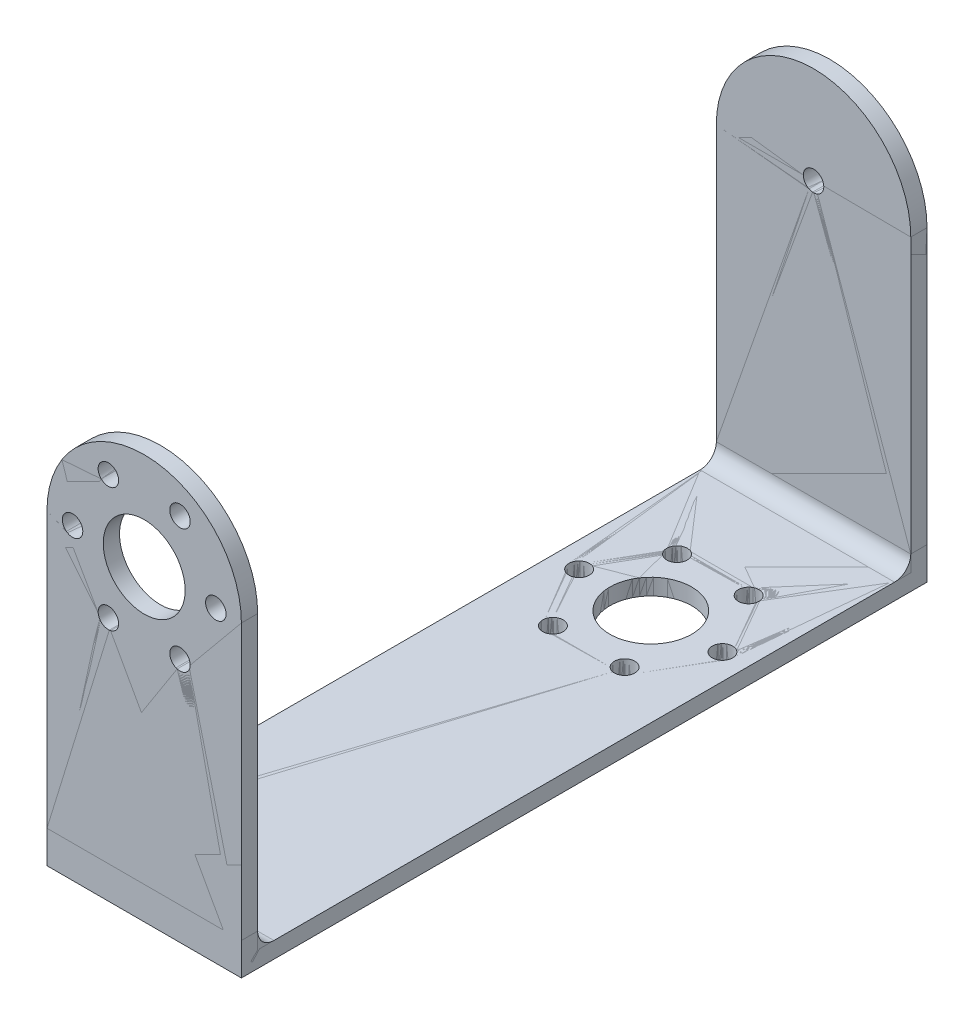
ISO-10303-21;
HEADER;
FILE_DESCRIPTION(('STEP AP214'),'2;1');
FILE_NAME('part.step','',(''),(''),'','','');
FILE_SCHEMA(('AUTOMOTIVE_DESIGN { 1 0 10303 214 1 1 1 1 }'));
ENDSEC;
DATA;
#1=APPLICATION_CONTEXT('core data for automotive mechanical design processes');
#2=APPLICATION_PROTOCOL_DEFINITION('international standard','automotive_design',2000,#1);
#3=PRODUCT_CONTEXT('',#1,'mechanical');
#4=PRODUCT('Part','Part','',(#3));
#5=PRODUCT_RELATED_PRODUCT_CATEGORY('part','',(#4));
#6=PRODUCT_DEFINITION_FORMATION('','',#4);
#7=PRODUCT_DEFINITION_CONTEXT('part definition',#1,'design');
#8=PRODUCT_DEFINITION('design','',#6,#7);
#9=PRODUCT_DEFINITION_SHAPE('','',#8);
#10=(LENGTH_UNIT() NAMED_UNIT(*) SI_UNIT(.MILLI.,.METRE.));
#11=(NAMED_UNIT(*) PLANE_ANGLE_UNIT() SI_UNIT($,.RADIAN.));
#12=(NAMED_UNIT(*) SI_UNIT($,.STERADIAN.) SOLID_ANGLE_UNIT());
#13=UNCERTAINTY_MEASURE_WITH_UNIT(LENGTH_MEASURE(1.E-05),#10,'distance_accuracy_value','');
#14=(GEOMETRIC_REPRESENTATION_CONTEXT(3) GLOBAL_UNCERTAINTY_ASSIGNED_CONTEXT((#13)) GLOBAL_UNIT_ASSIGNED_CONTEXT((#10,
#11,#12)) REPRESENTATION_CONTEXT('',''));
#15=CARTESIAN_POINT('',(0.,0.,0.));
#16=DIRECTION('',(0.,0.,1.));
#17=DIRECTION('',(1.,0.,0.));
#18=AXIS2_PLACEMENT_3D('',#15,#16,#17);
#19=CARTESIAN_POINT('',(9.5,0.,33.5));
#20=DIRECTION('',(-1.,0.,0.));
#21=DIRECTION('',(0.,0.,-1.));
#22=AXIS2_PLACEMENT_3D('',#19,#20,#21);
#23=PLANE('',#22);
#24=DIRECTION('',(0.,-1.,0.));
#25=VECTOR('',#24,1.);
#26=CARTESIAN_POINT('',(9.5,0.,-30.325));
#27=LINE('',#26,#25);
#28=CARTESIAN_POINT('',(9.5,1.5875,-30.325));
#29=VERTEX_POINT('',#28);
#30=CARTESIAN_POINT('',(9.5,0.,-30.325));
#31=VERTEX_POINT('',#30);
#32=EDGE_CURVE('E12',#29,#31,#27,.T.);
#33=ORIENTED_EDGE('',*,*,#32,.F.);
#34=DIRECTION('',(0.,0.,-1.));
#35=VECTOR('',#34,1.);
#36=CARTESIAN_POINT('',(9.5,1.5875,0.));
#37=LINE('',#36,#35);
#38=CARTESIAN_POINT('',(9.5,1.5875,30.325));
#39=VERTEX_POINT('',#38);
#40=EDGE_CURVE('E172',#39,#29,#37,.T.);
#41=ORIENTED_EDGE('',*,*,#40,.F.);
#42=DIRECTION('',(0.,-1.,0.));
#43=VECTOR('',#42,1.);
#44=CARTESIAN_POINT('',(9.5,0.,30.325));
#45=LINE('',#44,#43);
#46=CARTESIAN_POINT('',(9.5,0.,30.325));
#47=VERTEX_POINT('',#46);
#48=EDGE_CURVE('E58',#39,#47,#45,.T.);
#49=ORIENTED_EDGE('',*,*,#48,.T.);
#50=DIRECTION('',(0.,0.,-1.));
#51=VECTOR('',#50,1.);
#52=CARTESIAN_POINT('',(9.5,0.,33.5));
#53=LINE('',#52,#51);
#54=EDGE_CURVE('E474',#47,#31,#53,.T.);
#55=ORIENTED_EDGE('',*,*,#54,.T.);
#56=EDGE_LOOP('',(#33,#41,#49,#55));
#57=FACE_BOUND('',#56,.T.);
#58=ADVANCED_FACE('F48',(#57),#23,.F.);
#59=CARTESIAN_POINT('',(9.5,3.175,30.325));
#60=DIRECTION('',(-1.,0.,0.));
#61=DIRECTION('',(0.,0.,1.));
#62=AXIS2_PLACEMENT_3D('',#59,#60,#61);
#63=PLANE('',#62);
#64=ORIENTED_EDGE('',*,*,#48,.F.);
#65=CARTESIAN_POINT('',(9.5,3.175,30.325));
#66=DIRECTION('',(-1.,0.,0.));
#67=DIRECTION('',(0.,0.,1.));
#68=AXIS2_PLACEMENT_3D('',#65,#66,#67);
#69=CIRCLE('',#68,1.5875);
#70=CARTESIAN_POINT('',(9.5,3.175,31.9125));
#71=VERTEX_POINT('',#70);
#72=EDGE_CURVE('E160',#39,#71,#69,.T.);
#73=ORIENTED_EDGE('',*,*,#72,.T.);
#74=DIRECTION('',(0.,0.,1.));
#75=VECTOR('',#74,1.);
#76=CARTESIAN_POINT('',(9.5,3.175,33.5));
#77=LINE('',#76,#75);
#78=CARTESIAN_POINT('',(9.5,3.175,33.5));
#79=VERTEX_POINT('',#78);
#80=EDGE_CURVE('E370',#71,#79,#77,.T.);
#81=ORIENTED_EDGE('',*,*,#80,.T.);
#82=CARTESIAN_POINT('',(9.5,3.175,30.325));
#83=DIRECTION('',(1.,0.,0.));
#84=DIRECTION('',(0.,0.,-1.));
#85=AXIS2_PLACEMENT_3D('',#82,#83,#84);
#86=CIRCLE('',#85,3.175);
#87=EDGE_CURVE('E378',#47,#79,#86,.F.);
#88=ORIENTED_EDGE('',*,*,#87,.F.);
#89=EDGE_LOOP('',(#64,#73,#81,#88));
#90=FACE_BOUND('',#89,.T.);
#91=ADVANCED_FACE('F377',(#90),#63,.F.);
#92=CARTESIAN_POINT('',(9.5,1.5875,33.5));
#93=DIRECTION('',(1.,0.,0.));
#94=DIRECTION('',(0.,-1.,0.));
#95=AXIS2_PLACEMENT_3D('',#92,#93,#94);
#96=PLANE('',#95);
#97=ORIENTED_EDGE('',*,*,#80,.F.);
#98=DIRECTION('',(0.,1.,0.));
#99=VECTOR('',#98,1.);
#100=CARTESIAN_POINT('',(9.5,1.5875,31.9125));
#101=LINE('',#100,#99);
#102=CARTESIAN_POINT('',(9.5,30.0430013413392,31.9125));
#103=VERTEX_POINT('',#102);
#104=EDGE_CURVE('E142',#103,#71,#101,.F.);
#105=ORIENTED_EDGE('',*,*,#104,.F.);
#106=DIRECTION('',(0.,0.,1.));
#107=VECTOR('',#106,1.);
#108=CARTESIAN_POINT('',(9.5,30.0430013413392,33.5));
#109=LINE('',#108,#107);
#110=CARTESIAN_POINT('',(9.5,30.0430013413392,33.5));
#111=VERTEX_POINT('',#110);
#112=EDGE_CURVE('E367',#103,#111,#109,.T.);
#113=ORIENTED_EDGE('',*,*,#112,.T.);
#114=DIRECTION('',(0.,-1.,0.));
#115=VECTOR('',#114,1.);
#116=CARTESIAN_POINT('',(9.5,1.5875,33.5));
#117=LINE('',#116,#115);
#118=EDGE_CURVE('E395',#111,#79,#117,.T.);
#119=ORIENTED_EDGE('',*,*,#118,.T.);
#120=EDGE_LOOP('',(#97,#105,#113,#119));
#121=FACE_BOUND('',#120,.T.);
#122=ADVANCED_FACE('F396',(#121),#96,.T.);
#123=CARTESIAN_POINT('',(0.,30.0430013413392,33.5));
#124=DIRECTION('',(0.,0.,1.));
#125=DIRECTION('',(1.,0.,0.));
#126=AXIS2_PLACEMENT_3D('',#123,#124,#125);
#127=CYLINDRICAL_SURFACE('',#126,9.5);
#128=ORIENTED_EDGE('',*,*,#112,.F.);
#129=CARTESIAN_POINT('',(0.,30.0430013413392,31.9125));
#130=DIRECTION('',(0.,0.,1.));
#131=DIRECTION('',(1.,0.,0.));
#132=AXIS2_PLACEMENT_3D('',#129,#130,#131);
#133=CIRCLE('',#132,9.5);
#134=CARTESIAN_POINT('',(-9.5,30.0430013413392,31.9125));
#135=VERTEX_POINT('',#134);
#136=EDGE_CURVE('E165',#135,#103,#133,.F.);
#137=ORIENTED_EDGE('',*,*,#136,.F.);
#138=DIRECTION('',(0.,0.,1.));
#139=VECTOR('',#138,1.);
#140=CARTESIAN_POINT('',(-9.5,30.0430013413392,33.5));
#141=LINE('',#140,#139);
#142=CARTESIAN_POINT('',(-9.5,30.0430013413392,33.5));
#143=VERTEX_POINT('',#142);
#144=EDGE_CURVE('E364',#135,#143,#141,.T.);
#145=ORIENTED_EDGE('',*,*,#144,.T.);
#146=CARTESIAN_POINT('',(0.,30.0430013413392,33.5));
#147=DIRECTION('',(0.,0.,1.));
#148=DIRECTION('',(1.,0.,0.));
#149=AXIS2_PLACEMENT_3D('',#146,#147,#148);
#150=CIRCLE('',#149,9.5);
#151=EDGE_CURVE('E400',#143,#111,#150,.F.);
#152=ORIENTED_EDGE('',*,*,#151,.T.);
#153=EDGE_LOOP('',(#128,#137,#145,#152));
#154=FACE_BOUND('',#153,.T.);
#155=ADVANCED_FACE('F426',(#154),#127,.T.);
#156=CARTESIAN_POINT('',(-9.5,1.5875,33.5));
#157=DIRECTION('',(1.,0.,0.));
#158=DIRECTION('',(0.,-1.,0.));
#159=AXIS2_PLACEMENT_3D('',#156,#157,#158);
#160=PLANE('',#159);
#161=ORIENTED_EDGE('',*,*,#144,.F.);
#162=DIRECTION('',(0.,1.,0.));
#163=VECTOR('',#162,1.);
#164=CARTESIAN_POINT('',(-9.5,1.5875,31.9125));
#165=LINE('',#164,#163);
#166=CARTESIAN_POINT('',(-9.5,3.175,31.9125));
#167=VERTEX_POINT('',#166);
#168=EDGE_CURVE('E161',#135,#167,#165,.F.);
#169=ORIENTED_EDGE('',*,*,#168,.T.);
#170=DIRECTION('',(0.,0.,1.));
#171=VECTOR('',#170,1.);
#172=CARTESIAN_POINT('',(-9.5,3.175,33.5));
#173=LINE('',#172,#171);
#174=CARTESIAN_POINT('',(-9.5,3.175,33.5));
#175=VERTEX_POINT('',#174);
#176=EDGE_CURVE('E361',#167,#175,#173,.T.);
#177=ORIENTED_EDGE('',*,*,#176,.T.);
#178=DIRECTION('',(0.,-1.,0.));
#179=VECTOR('',#178,1.);
#180=CARTESIAN_POINT('',(-9.5,1.5875,33.5));
#181=LINE('',#180,#179);
#182=EDGE_CURVE('E405',#143,#175,#181,.T.);
#183=ORIENTED_EDGE('',*,*,#182,.F.);
#184=EDGE_LOOP('',(#161,#169,#177,#183));
#185=FACE_BOUND('',#184,.T.);
#186=ADVANCED_FACE('F514',(#185),#160,.F.);
#187=CARTESIAN_POINT('',(-9.5,3.175,30.325));
#188=DIRECTION('',(-1.,0.,0.));
#189=DIRECTION('',(0.,0.,1.));
#190=AXIS2_PLACEMENT_3D('',#187,#188,#189);
#191=PLANE('',#190);
#192=ORIENTED_EDGE('',*,*,#176,.F.);
#193=CARTESIAN_POINT('',(-9.5,3.175,30.325));
#194=DIRECTION('',(-1.,0.,0.));
#195=DIRECTION('',(0.,0.,1.));
#196=AXIS2_PLACEMENT_3D('',#193,#194,#195);
#197=CIRCLE('',#196,1.5875);
#198=CARTESIAN_POINT('',(-9.5,1.5875,30.325));
#199=VERTEX_POINT('',#198);
#200=EDGE_CURVE('E157',#167,#199,#197,.F.);
#201=ORIENTED_EDGE('',*,*,#200,.T.);
#202=DIRECTION('',(0.,-1.,0.));
#203=VECTOR('',#202,1.);
#204=CARTESIAN_POINT('',(-9.5,0.,30.325));
#205=LINE('',#204,#203);
#206=CARTESIAN_POINT('',(-9.5,0.,30.325));
#207=VERTEX_POINT('',#206);
#208=EDGE_CURVE('E354',#199,#207,#205,.T.);
#209=ORIENTED_EDGE('',*,*,#208,.T.);
#210=CARTESIAN_POINT('',(-9.5,3.175,30.325));
#211=DIRECTION('',(1.,0.,0.));
#212=DIRECTION('',(0.,0.,-1.));
#213=AXIS2_PLACEMENT_3D('',#210,#211,#212);
#214=CIRCLE('',#213,3.175);
#215=EDGE_CURVE('E391',#175,#207,#214,.T.);
#216=ORIENTED_EDGE('',*,*,#215,.F.);
#217=EDGE_LOOP('',(#192,#201,#209,#216));
#218=FACE_BOUND('',#217,.T.);
#219=ADVANCED_FACE('F516',(#218),#191,.T.);
#220=CARTESIAN_POINT('',(-9.5,0.,33.5));
#221=DIRECTION('',(1.,0.,0.));
#222=DIRECTION('',(0.,0.,1.));
#223=AXIS2_PLACEMENT_3D('',#220,#221,#222);
#224=PLANE('',#223);
#225=ORIENTED_EDGE('',*,*,#208,.F.);
#226=DIRECTION('',(0.,0.,-1.));
#227=VECTOR('',#226,1.);
#228=CARTESIAN_POINT('',(-9.5,1.5875,0.));
#229=LINE('',#228,#227);
#230=CARTESIAN_POINT('',(-9.5,1.5875,-30.325));
#231=VERTEX_POINT('',#230);
#232=EDGE_CURVE('E173',#231,#199,#229,.F.);
#233=ORIENTED_EDGE('',*,*,#232,.F.);
#234=CARTESIAN_POINT('',(-9.5,0.,-30.325));
#235=CARTESIAN_POINT('',(-9.5,1.5875,-30.325));
#236=B_SPLINE_CURVE_WITH_KNOTS('',1,(#234,#235),.UNSPECIFIED.,.F.,.F.,(2,2),(0.,1.),.UNSPECIFIED.);
#237=CARTESIAN_POINT('',(-9.5,0.,-30.325));
#238=VERTEX_POINT('',#237);
#239=EDGE_CURVE('E341',#231,#238,#236,.F.);
#240=ORIENTED_EDGE('',*,*,#239,.T.);
#241=DIRECTION('',(0.,0.,1.));
#242=VECTOR('',#241,1.);
#243=CARTESIAN_POINT('',(-9.5,0.,33.5));
#244=LINE('',#243,#242);
#245=EDGE_CURVE('E476',#238,#207,#244,.T.);
#246=ORIENTED_EDGE('',*,*,#245,.T.);
#247=EDGE_LOOP('',(#225,#233,#240,#246));
#248=FACE_BOUND('',#247,.T.);
#249=ADVANCED_FACE('F296',(#248),#224,.F.);
#250=CARTESIAN_POINT('',(-9.50473763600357,3.175,-33.5));
#251=CARTESIAN_POINT('',(-9.50473763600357,2.80125971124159,-33.5));
#252=CARTESIAN_POINT('',(-9.50444153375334,2.39424590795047,-33.4311404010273));
#253=CARTESIAN_POINT('',(-9.50355322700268,1.61209264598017,-33.1205331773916));
#254=CARTESIAN_POINT('',(-9.50296102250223,1.23846152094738,-32.8785895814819));
#255=CARTESIAN_POINT('',(-9.50177661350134,0.621410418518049,-32.2615384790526));
#256=CARTESIAN_POINT('',(-9.50118440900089,0.379466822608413,-31.8879073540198));
#257=CARTESIAN_POINT('',(-9.50029610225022,0.0688595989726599,-31.1057540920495));
#258=CARTESIAN_POINT('',(-9.5,0.,-30.6987402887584));
#259=CARTESIAN_POINT('',(-9.5,0.,-30.325));
#260=CARTESIAN_POINT('',(-9.50473763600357,3.175,-31.9125));
#261=CARTESIAN_POINT('',(-9.50473763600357,2.98812985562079,-31.9125));
#262=CARTESIAN_POINT('',(-9.50444153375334,2.78462295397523,-31.8780702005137));
#263=CARTESIAN_POINT('',(-9.50355322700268,2.39354632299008,-31.7227665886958));
#264=CARTESIAN_POINT('',(-9.50296102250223,2.20673076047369,-31.601794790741));
#265=CARTESIAN_POINT('',(-9.50177661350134,1.89820520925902,-31.2932692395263));
#266=CARTESIAN_POINT('',(-9.50118440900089,1.77723341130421,-31.1064536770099));
#267=CARTESIAN_POINT('',(-9.50029610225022,1.62192979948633,-30.7153770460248));
#268=CARTESIAN_POINT('',(-9.5,1.5875,-30.5118701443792));
#269=CARTESIAN_POINT('',(-9.5,1.5875,-30.325));
#270=B_SPLINE_SURFACE_WITH_KNOTS('',1,3,((#250,#251,#252,#253,#254,#255,#256,#257,#258,#259),
(#260,#261,#262,#263,#264,#265,#266,#267,#268,#269)),.UNSPECIFIED.,.F.,.F.,.F.,(2,2),(4,2,2,2,
4),(0.,1.),(0.,0.25,0.5,0.75,1.),.UNSPECIFIED.);
#271=CARTESIAN_POINT('',(-9.5,1.5875,-30.325));
#272=CARTESIAN_POINT('',(-9.5,1.5875,-30.5118701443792));
#273=CARTESIAN_POINT('',(-9.50029610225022,1.62192979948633,-30.7153770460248));
#274=CARTESIAN_POINT('',(-9.50118440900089,1.77723341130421,-31.1064536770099));
#275=CARTESIAN_POINT('',(-9.50177661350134,1.89820520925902,-31.2932692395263));
#276=CARTESIAN_POINT('',(-9.50296102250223,2.20673076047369,-31.601794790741));
#277=CARTESIAN_POINT('',(-9.50355322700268,2.39354632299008,-31.7227665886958));
#278=CARTESIAN_POINT('',(-9.50444153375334,2.78462295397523,-31.8780702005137));
#279=CARTESIAN_POINT('',(-9.50473763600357,2.98812985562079,-31.9125));
#280=CARTESIAN_POINT('',(-9.50473763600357,3.175,-31.9125));
#281=B_SPLINE_CURVE_WITH_KNOTS('',3,(#271,#272,#273,#274,#275,#276,#277,#278,#279,#280),
.UNSPECIFIED.,.F.,.F.,(4,2,2,2,4),(0.,0.25,0.5,0.75,1.),.UNSPECIFIED.);
#282=CARTESIAN_POINT('',(-9.50473763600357,3.175,-31.9125));
#283=VERTEX_POINT('',#282);
#284=EDGE_CURVE('E143',#231,#283,#281,.T.);
#285=CARTESIAN_POINT('',(-9.50473763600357,3.175,-31.9125));
#286=CARTESIAN_POINT('',(-9.50473763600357,3.175,-33.5));
#287=B_SPLINE_CURVE_WITH_KNOTS('',1,(#285,#286),.UNSPECIFIED.,.F.,.F.,(2,2),(0.,1.),.UNSPECIFIED.);
#288=CARTESIAN_POINT('',(-9.50473763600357,3.175,-33.5));
#289=VERTEX_POINT('',#288);
#290=EDGE_CURVE('E327',#283,#289,#287,.T.);
#291=CARTESIAN_POINT('',(-9.50473763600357,3.175,-33.5));
#292=CARTESIAN_POINT('',(-9.50473763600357,2.80125971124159,-33.5));
#293=CARTESIAN_POINT('',(-9.50444153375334,2.39424590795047,-33.4311404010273));
#294=CARTESIAN_POINT('',(-9.50355322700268,1.61209264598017,-33.1205331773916));
#295=CARTESIAN_POINT('',(-9.50296102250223,1.23846152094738,-32.8785895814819));
#296=CARTESIAN_POINT('',(-9.50177661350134,0.621410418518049,-32.2615384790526));
#297=CARTESIAN_POINT('',(-9.50118440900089,0.379466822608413,-31.8879073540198));
#298=CARTESIAN_POINT('',(-9.50029610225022,0.0688595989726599,-31.1057540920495));
#299=CARTESIAN_POINT('',(-9.5,0.,-30.6987402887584));
#300=CARTESIAN_POINT('',(-9.5,0.,-30.325));
#301=B_SPLINE_CURVE_WITH_KNOTS('',3,(#291,#292,#293,#294,#295,#296,#297,#298,#299,#300),
.UNSPECIFIED.,.F.,.F.,(4,2,2,2,4),(0.,0.25,0.5,0.75,1.),.UNSPECIFIED.);
#302=EDGE_CURVE('E276',#238,#289,#301,.F.);
#303=ORIENTED_EDGE('',*,*,#239,.F.);
#304=ORIENTED_EDGE('',*,*,#284,.T.);
#305=ORIENTED_EDGE('',*,*,#290,.T.);
#306=ORIENTED_EDGE('',*,*,#302,.F.);
#307=EDGE_LOOP('',(#303,#304,#305,#306));
#308=FACE_BOUND('',#307,.T.);
#309=ADVANCED_FACE('F283',(#308),#270,.F.);
#310=CARTESIAN_POINT('',(-9.50473763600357,0.,-33.5));
#311=DIRECTION('',(1.,0.,0.));
#312=DIRECTION('',(0.,1.,0.));
#313=AXIS2_PLACEMENT_3D('',#310,#311,#312);
#314=PLANE('',#313);
#315=ORIENTED_EDGE('',*,*,#290,.F.);
#316=DIRECTION('',(0.,1.,0.));
#317=VECTOR('',#316,1.);
#318=CARTESIAN_POINT('',(-9.50473763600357,1.5875,-31.9125));
#319=LINE('',#318,#317);
#320=CARTESIAN_POINT('',(-9.50473763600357,30.,-31.9125));
#321=VERTEX_POINT('',#320);
#322=EDGE_CURVE('E132',#283,#321,#319,.T.);
#323=ORIENTED_EDGE('',*,*,#322,.T.);
#324=DIRECTION('',(0.,0.,-1.));
#325=VECTOR('',#324,1.);
#326=CARTESIAN_POINT('',(-9.50473763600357,30.,-33.5));
#327=LINE('',#326,#325);
#328=CARTESIAN_POINT('',(-9.50473763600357,30.,-33.5));
#329=VERTEX_POINT('',#328);
#330=EDGE_CURVE('E506',#321,#329,#327,.T.);
#331=ORIENTED_EDGE('',*,*,#330,.T.);
#332=DIRECTION('',(0.,1.,0.));
#333=VECTOR('',#332,1.);
#334=CARTESIAN_POINT('',(-9.50473763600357,0.,-33.5));
#335=LINE('',#334,#333);
#336=EDGE_CURVE('E225',#289,#329,#335,.T.);
#337=ORIENTED_EDGE('',*,*,#336,.F.);
#338=EDGE_LOOP('',(#315,#323,#331,#337));
#339=FACE_BOUND('',#338,.T.);
#340=ADVANCED_FACE('F295',(#339),#314,.F.);
#341=CARTESIAN_POINT('',(-0.00236881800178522,30.,-33.5));
#342=DIRECTION('',(0.,0.,-1.));
#343=DIRECTION('',(-1.,0.,0.));
#344=AXIS2_PLACEMENT_3D('',#341,#342,#343);
#345=CYLINDRICAL_SURFACE('',#344,9.50236881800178);
#346=ORIENTED_EDGE('',*,*,#330,.F.);
#347=CARTESIAN_POINT('',(-0.00236881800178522,30.,-31.9125));
#348=DIRECTION('',(0.,0.,-1.));
#349=DIRECTION('',(-1.,0.,0.));
#350=AXIS2_PLACEMENT_3D('',#347,#348,#349);
#351=CIRCLE('',#350,9.50236881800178);
#352=CARTESIAN_POINT('',(9.5,30.,-31.9125));
#353=VERTEX_POINT('',#352);
#354=EDGE_CURVE('E148',#321,#353,#351,.T.);
#355=ORIENTED_EDGE('',*,*,#354,.T.);
#356=DIRECTION('',(0.,0.,-1.));
#357=VECTOR('',#356,1.);
#358=CARTESIAN_POINT('',(9.5,30.,-33.5));
#359=LINE('',#358,#357);
#360=CARTESIAN_POINT('',(9.5,30.,-33.5));
#361=VERTEX_POINT('',#360);
#362=EDGE_CURVE('E120',#353,#361,#359,.T.);
#363=ORIENTED_EDGE('',*,*,#362,.T.);
#364=CARTESIAN_POINT('',(-0.00236881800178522,30.,-33.5));
#365=DIRECTION('',(0.,0.,-1.));
#366=DIRECTION('',(-1.,0.,0.));
#367=AXIS2_PLACEMENT_3D('',#364,#365,#366);
#368=CIRCLE('',#367,9.50236881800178);
#369=EDGE_CURVE('E477',#329,#361,#368,.T.);
#370=ORIENTED_EDGE('',*,*,#369,.F.);
#371=EDGE_LOOP('',(#346,#355,#363,#370));
#372=FACE_BOUND('',#371,.T.);
#373=ADVANCED_FACE('F505',(#372),#345,.T.);
#374=CARTESIAN_POINT('',(9.5,1.5875,-33.5));
#375=DIRECTION('',(-1.,0.,0.));
#376=DIRECTION('',(0.,-1.,0.));
#377=AXIS2_PLACEMENT_3D('',#374,#375,#376);
#378=PLANE('',#377);
#379=ORIENTED_EDGE('',*,*,#362,.F.);
#380=DIRECTION('',(0.,1.,0.));
#381=VECTOR('',#380,1.);
#382=CARTESIAN_POINT('',(9.5,1.5875,-31.9125));
#383=LINE('',#382,#381);
#384=CARTESIAN_POINT('',(9.5,3.175,-31.9125));
#385=VERTEX_POINT('',#384);
#386=EDGE_CURVE('E130',#353,#385,#383,.F.);
#387=ORIENTED_EDGE('',*,*,#386,.T.);
#388=DIRECTION('',(0.,0.,-1.));
#389=VECTOR('',#388,1.);
#390=CARTESIAN_POINT('',(9.5,3.175,-33.5));
#391=LINE('',#390,#389);
#392=CARTESIAN_POINT('',(9.5,3.175,-33.5));
#393=VERTEX_POINT('',#392);
#394=EDGE_CURVE('E52',#385,#393,#391,.T.);
#395=ORIENTED_EDGE('',*,*,#394,.T.);
#396=DIRECTION('',(0.,-1.,0.));
#397=VECTOR('',#396,1.);
#398=CARTESIAN_POINT('',(9.5,1.5875,-33.5));
#399=LINE('',#398,#397);
#400=EDGE_CURVE('E480',#361,#393,#399,.T.);
#401=ORIENTED_EDGE('',*,*,#400,.F.);
#402=EDGE_LOOP('',(#379,#387,#395,#401));
#403=FACE_BOUND('',#402,.T.);
#404=ADVANCED_FACE('F145',(#403),#378,.F.);
#405=CARTESIAN_POINT('',(3.49999999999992,23.9808235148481,33.5));
#406=DIRECTION('',(0.,0.,1.));
#407=DIRECTION('',(1.,0.,0.));
#408=AXIS2_PLACEMENT_3D('',#405,#406,#407);
#409=CYLINDRICAL_SURFACE('',#408,1.);
#410=CARTESIAN_POINT('',(3.49999999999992,23.9808235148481,33.5));
#411=DIRECTION('',(0.,0.,1.));
#412=DIRECTION('',(1.,0.,0.));
#413=AXIS2_PLACEMENT_3D('',#410,#411,#412);
#414=CIRCLE('',#413,1.);
#415=CARTESIAN_POINT('',(4.49999999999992,23.9808235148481,33.5));
#416=VERTEX_POINT('',#415);
#417=EDGE_CURVE('E430',#416,#416,#414,.T.);
#418=ORIENTED_EDGE('',*,*,#417,.T.);
#419=EDGE_LOOP('',(#418));
#420=FACE_BOUND('',#419,.T.);
#421=CARTESIAN_POINT('',(3.49999999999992,23.9808235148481,31.9125));
#422=DIRECTION('',(0.,0.,1.));
#423=DIRECTION('',(1.,0.,0.));
#424=AXIS2_PLACEMENT_3D('',#421,#422,#423);
#425=CIRCLE('',#424,1.);
#426=CARTESIAN_POINT('',(4.49999999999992,23.9808235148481,31.9125));
#427=VERTEX_POINT('',#426);
#428=EDGE_CURVE('E164',#427,#427,#425,.T.);
#429=ORIENTED_EDGE('',*,*,#428,.F.);
#430=EDGE_LOOP('',(#429));
#431=FACE_BOUND('',#430,.T.);
#432=ADVANCED_FACE('F560',(#420,#431),#409,.F.);
#433=CARTESIAN_POINT('',(7.,30.0430013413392,33.5));
#434=DIRECTION('',(0.,0.,1.));
#435=DIRECTION('',(1.,0.,0.));
#436=AXIS2_PLACEMENT_3D('',#433,#434,#435);
#437=CYLINDRICAL_SURFACE('',#436,1.);
#438=CARTESIAN_POINT('',(7.,30.0430013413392,33.5));
#439=DIRECTION('',(0.,0.,1.));
#440=DIRECTION('',(1.,0.,0.));
#441=AXIS2_PLACEMENT_3D('',#438,#439,#440);
#442=CIRCLE('',#441,1.);
#443=CARTESIAN_POINT('',(8.,30.0430013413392,33.5));
#444=VERTEX_POINT('',#443);
#445=EDGE_CURVE('E435',#444,#444,#442,.T.);
#446=ORIENTED_EDGE('',*,*,#445,.T.);
#447=EDGE_LOOP('',(#446));
#448=FACE_BOUND('',#447,.T.);
#449=CARTESIAN_POINT('',(7.,30.0430013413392,31.9125));
#450=DIRECTION('',(0.,0.,1.));
#451=DIRECTION('',(1.,0.,0.));
#452=AXIS2_PLACEMENT_3D('',#449,#450,#451);
#453=CIRCLE('',#452,1.);
#454=CARTESIAN_POINT('',(8.,30.0430013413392,31.9125));
#455=VERTEX_POINT('',#454);
#456=EDGE_CURVE('E199',#455,#455,#453,.T.);
#457=ORIENTED_EDGE('',*,*,#456,.F.);
#458=EDGE_LOOP('',(#457));
#459=FACE_BOUND('',#458,.T.);
#460=ADVANCED_FACE('F563',(#448,#459),#437,.F.);
#461=CARTESIAN_POINT('',(3.50000000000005,36.1051791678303,33.5));
#462=DIRECTION('',(0.,0.,1.));
#463=DIRECTION('',(1.,0.,0.));
#464=AXIS2_PLACEMENT_3D('',#461,#462,#463);
#465=CYLINDRICAL_SURFACE('',#464,1.);
#466=CARTESIAN_POINT('',(3.50000000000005,36.1051791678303,33.5));
#467=DIRECTION('',(0.,0.,1.));
#468=DIRECTION('',(1.,0.,0.));
#469=AXIS2_PLACEMENT_3D('',#466,#467,#468);
#470=CIRCLE('',#469,1.);
#471=CARTESIAN_POINT('',(4.50000000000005,36.1051791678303,33.5));
#472=VERTEX_POINT('',#471);
#473=EDGE_CURVE('E438',#472,#472,#470,.T.);
#474=ORIENTED_EDGE('',*,*,#473,.T.);
#475=EDGE_LOOP('',(#474));
#476=FACE_BOUND('',#475,.T.);
#477=CARTESIAN_POINT('',(3.50000000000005,36.1051791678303,31.9125));
#478=DIRECTION('',(0.,0.,1.));
#479=DIRECTION('',(1.,0.,0.));
#480=AXIS2_PLACEMENT_3D('',#477,#478,#479);
#481=CIRCLE('',#480,1.);
#482=CARTESIAN_POINT('',(4.50000000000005,36.1051791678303,31.9125));
#483=VERTEX_POINT('',#482);
#484=EDGE_CURVE('E202',#483,#483,#481,.T.);
#485=ORIENTED_EDGE('',*,*,#484,.F.);
#486=EDGE_LOOP('',(#485));
#487=FACE_BOUND('',#486,.T.);
#488=ADVANCED_FACE('F567',(#476,#487),#465,.F.);
#489=CARTESIAN_POINT('',(-3.49999999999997,36.1051791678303,33.5));
#490=DIRECTION('',(0.,0.,1.));
#491=DIRECTION('',(1.,0.,0.));
#492=AXIS2_PLACEMENT_3D('',#489,#490,#491);
#493=CYLINDRICAL_SURFACE('',#492,1.);
#494=CARTESIAN_POINT('',(-3.49999999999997,36.1051791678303,33.5));
#495=DIRECTION('',(0.,0.,1.));
#496=DIRECTION('',(1.,0.,0.));
#497=AXIS2_PLACEMENT_3D('',#494,#495,#496);
#498=CIRCLE('',#497,1.);
#499=CARTESIAN_POINT('',(-2.49999999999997,36.1051791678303,33.5));
#500=VERTEX_POINT('',#499);
#501=EDGE_CURVE('E441',#500,#500,#498,.T.);
#502=ORIENTED_EDGE('',*,*,#501,.T.);
#503=EDGE_LOOP('',(#502));
#504=FACE_BOUND('',#503,.T.);
#505=CARTESIAN_POINT('',(-3.49999999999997,36.1051791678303,31.9125));
#506=DIRECTION('',(0.,0.,1.));
#507=DIRECTION('',(1.,0.,0.));
#508=AXIS2_PLACEMENT_3D('',#505,#506,#507);
#509=CIRCLE('',#508,1.);
#510=CARTESIAN_POINT('',(-2.49999999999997,36.1051791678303,31.9125));
#511=VERTEX_POINT('',#510);
#512=EDGE_CURVE('E205',#511,#511,#509,.T.);
#513=ORIENTED_EDGE('',*,*,#512,.F.);
#514=EDGE_LOOP('',(#513));
#515=FACE_BOUND('',#514,.T.);
#516=ADVANCED_FACE('F571',(#504,#515),#493,.F.);
#517=CARTESIAN_POINT('',(-7.,30.0430013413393,33.5));
#518=DIRECTION('',(0.,0.,1.));
#519=DIRECTION('',(1.,0.,0.));
#520=AXIS2_PLACEMENT_3D('',#517,#518,#519);
#521=CYLINDRICAL_SURFACE('',#520,1.);
#522=CARTESIAN_POINT('',(-7.,30.0430013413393,33.5));
#523=DIRECTION('',(0.,0.,1.));
#524=DIRECTION('',(1.,0.,0.));
#525=AXIS2_PLACEMENT_3D('',#522,#523,#524);
#526=CIRCLE('',#525,1.);
#527=CARTESIAN_POINT('',(-6.,30.0430013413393,33.5));
#528=VERTEX_POINT('',#527);
#529=EDGE_CURVE('E444',#528,#528,#526,.T.);
#530=ORIENTED_EDGE('',*,*,#529,.T.);
#531=EDGE_LOOP('',(#530));
#532=FACE_BOUND('',#531,.T.);
#533=CARTESIAN_POINT('',(-7.,30.0430013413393,31.9125));
#534=DIRECTION('',(0.,0.,1.));
#535=DIRECTION('',(1.,0.,0.));
#536=AXIS2_PLACEMENT_3D('',#533,#534,#535);
#537=CIRCLE('',#536,1.);
#538=CARTESIAN_POINT('',(-6.,30.0430013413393,31.9125));
#539=VERTEX_POINT('',#538);
#540=EDGE_CURVE('E208',#539,#539,#537,.T.);
#541=ORIENTED_EDGE('',*,*,#540,.F.);
#542=EDGE_LOOP('',(#541));
#543=FACE_BOUND('',#542,.T.);
#544=ADVANCED_FACE('F575',(#532,#543),#521,.F.);
#545=CARTESIAN_POINT('',(-3.50000000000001,23.9808235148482,33.5));
#546=DIRECTION('',(0.,0.,1.));
#547=DIRECTION('',(1.,0.,0.));
#548=AXIS2_PLACEMENT_3D('',#545,#546,#547);
#549=CYLINDRICAL_SURFACE('',#548,0.999999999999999);
#550=CARTESIAN_POINT('',(-3.50000000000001,23.9808235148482,33.5));
#551=DIRECTION('',(0.,0.,1.));
#552=DIRECTION('',(1.,0.,0.));
#553=AXIS2_PLACEMENT_3D('',#550,#551,#552);
#554=CIRCLE('',#553,0.999999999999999);
#555=CARTESIAN_POINT('',(-2.50000000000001,23.9808235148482,33.5));
#556=VERTEX_POINT('',#555);
#557=EDGE_CURVE('E447',#556,#556,#554,.T.);
#558=ORIENTED_EDGE('',*,*,#557,.T.);
#559=EDGE_LOOP('',(#558));
#560=FACE_BOUND('',#559,.T.);
#561=CARTESIAN_POINT('',(-3.50000000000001,23.9808235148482,31.9125));
#562=DIRECTION('',(0.,0.,1.));
#563=DIRECTION('',(1.,0.,0.));
#564=AXIS2_PLACEMENT_3D('',#561,#562,#563);
#565=CIRCLE('',#564,0.999999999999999);
#566=CARTESIAN_POINT('',(-2.50000000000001,23.9808235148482,31.9125));
#567=VERTEX_POINT('',#566);
#568=EDGE_CURVE('E211',#567,#567,#565,.T.);
#569=ORIENTED_EDGE('',*,*,#568,.F.);
#570=EDGE_LOOP('',(#569));
#571=FACE_BOUND('',#570,.T.);
#572=ADVANCED_FACE('F578',(#560,#571),#549,.F.);
#573=CARTESIAN_POINT('',(0.,30.0430013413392,33.5));
#574=DIRECTION('',(0.,0.,1.));
#575=DIRECTION('',(1.,0.,0.));
#576=AXIS2_PLACEMENT_3D('',#573,#574,#575);
#577=CYLINDRICAL_SURFACE('',#576,4.);
#578=CARTESIAN_POINT('',(0.,30.0430013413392,33.5));
#579=DIRECTION('',(0.,0.,1.));
#580=DIRECTION('',(1.,0.,0.));
#581=AXIS2_PLACEMENT_3D('',#578,#579,#580);
#582=CIRCLE('',#581,4.);
#583=CARTESIAN_POINT('',(4.,30.0430013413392,33.5));
#584=VERTEX_POINT('',#583);
#585=EDGE_CURVE('E450',#584,#584,#582,.T.);
#586=ORIENTED_EDGE('',*,*,#585,.T.);
#587=EDGE_LOOP('',(#586));
#588=FACE_BOUND('',#587,.T.);
#589=CARTESIAN_POINT('',(0.,30.0430013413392,31.9125));
#590=DIRECTION('',(0.,0.,1.));
#591=DIRECTION('',(1.,0.,0.));
#592=AXIS2_PLACEMENT_3D('',#589,#590,#591);
#593=CIRCLE('',#592,4.);
#594=CARTESIAN_POINT('',(4.,30.0430013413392,31.9125));
#595=VERTEX_POINT('',#594);
#596=EDGE_CURVE('E180',#595,#595,#593,.T.);
#597=ORIENTED_EDGE('',*,*,#596,.F.);
#598=EDGE_LOOP('',(#597));
#599=FACE_BOUND('',#598,.T.);
#600=ADVANCED_FACE('F50',(#588,#599),#577,.F.);
#601=CARTESIAN_POINT('',(3.5,0.,-22.0684278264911));
#602=DIRECTION('',(0.,-1.,0.));
#603=DIRECTION('',(0.,0.,-1.));
#604=AXIS2_PLACEMENT_3D('',#601,#602,#603);
#605=CYLINDRICAL_SURFACE('',#604,1.);
#606=CARTESIAN_POINT('',(3.5,0.,-22.0684278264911));
#607=DIRECTION('',(0.,-1.,0.));
#608=DIRECTION('',(0.,0.,-1.));
#609=AXIS2_PLACEMENT_3D('',#606,#607,#608);
#610=CIRCLE('',#609,1.);
#611=CARTESIAN_POINT('',(3.5,0.,-23.0684278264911));
#612=VERTEX_POINT('',#611);
#613=EDGE_CURVE('E453',#612,#612,#610,.T.);
#614=ORIENTED_EDGE('',*,*,#613,.T.);
#615=EDGE_LOOP('',(#614));
#616=FACE_BOUND('',#615,.T.);
#617=CARTESIAN_POINT('',(3.5,1.5875,-22.0684278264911));
#618=DIRECTION('',(0.,-1.,0.));
#619=DIRECTION('',(0.,0.,-1.));
#620=AXIS2_PLACEMENT_3D('',#617,#618,#619);
#621=CIRCLE('',#620,1.);
#622=CARTESIAN_POINT('',(3.5,1.5875,-23.0684278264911));
#623=VERTEX_POINT('',#622);
#624=EDGE_CURVE('E176',#623,#623,#621,.T.);
#625=ORIENTED_EDGE('',*,*,#624,.F.);
#626=EDGE_LOOP('',(#625));
#627=FACE_BOUND('',#626,.T.);
#628=ADVANCED_FACE('F533',(#616,#627),#605,.F.);
#629=CARTESIAN_POINT('',(-3.5,0.,-9.94407217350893));
#630=DIRECTION('',(0.,-1.,0.));
#631=DIRECTION('',(0.,0.,-1.));
#632=AXIS2_PLACEMENT_3D('',#629,#630,#631);
#633=CYLINDRICAL_SURFACE('',#632,1.);
#634=CARTESIAN_POINT('',(-3.5,0.,-9.94407217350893));
#635=DIRECTION('',(0.,-1.,0.));
#636=DIRECTION('',(0.,0.,-1.));
#637=AXIS2_PLACEMENT_3D('',#634,#635,#636);
#638=CIRCLE('',#637,1.);
#639=CARTESIAN_POINT('',(-3.5,0.,-10.9440721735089));
#640=VERTEX_POINT('',#639);
#641=EDGE_CURVE('E456',#640,#640,#638,.T.);
#642=ORIENTED_EDGE('',*,*,#641,.T.);
#643=EDGE_LOOP('',(#642));
#644=FACE_BOUND('',#643,.T.);
#645=CARTESIAN_POINT('',(-3.5,1.5875,-9.94407217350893));
#646=DIRECTION('',(0.,-1.,0.));
#647=DIRECTION('',(0.,0.,-1.));
#648=AXIS2_PLACEMENT_3D('',#645,#646,#647);
#649=CIRCLE('',#648,1.);
#650=CARTESIAN_POINT('',(-3.5,1.5875,-10.9440721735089));
#651=VERTEX_POINT('',#650);
#652=EDGE_CURVE('E179',#651,#651,#649,.T.);
#653=ORIENTED_EDGE('',*,*,#652,.F.);
#654=EDGE_LOOP('',(#653));
#655=FACE_BOUND('',#654,.T.);
#656=ADVANCED_FACE('F536',(#644,#655),#633,.F.);
#657=CARTESIAN_POINT('',(-7.,0.,-16.00625));
#658=DIRECTION('',(0.,-1.,0.));
#659=DIRECTION('',(0.,0.,-1.));
#660=AXIS2_PLACEMENT_3D('',#657,#658,#659);
#661=CYLINDRICAL_SURFACE('',#660,1.);
#662=CARTESIAN_POINT('',(-7.,0.,-16.00625));
#663=DIRECTION('',(0.,-1.,0.));
#664=DIRECTION('',(0.,0.,-1.));
#665=AXIS2_PLACEMENT_3D('',#662,#663,#664);
#666=CIRCLE('',#665,1.);
#667=CARTESIAN_POINT('',(-7.,0.,-17.00625));
#668=VERTEX_POINT('',#667);
#669=EDGE_CURVE('E459',#668,#668,#666,.T.);
#670=ORIENTED_EDGE('',*,*,#669,.T.);
#671=EDGE_LOOP('',(#670));
#672=FACE_BOUND('',#671,.T.);
#673=CARTESIAN_POINT('',(-7.,1.5875,-16.00625));
#674=DIRECTION('',(0.,-1.,0.));
#675=DIRECTION('',(0.,0.,-1.));
#676=AXIS2_PLACEMENT_3D('',#673,#674,#675);
#677=CIRCLE('',#676,1.);
#678=CARTESIAN_POINT('',(-7.,1.5875,-17.00625));
#679=VERTEX_POINT('',#678);
#680=EDGE_CURVE('E183',#679,#679,#677,.T.);
#681=ORIENTED_EDGE('',*,*,#680,.F.);
#682=EDGE_LOOP('',(#681));
#683=FACE_BOUND('',#682,.T.);
#684=ADVANCED_FACE('F540',(#672,#683),#661,.F.);
#685=CARTESIAN_POINT('',(-3.5,0.,-22.0684278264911));
#686=DIRECTION('',(0.,-1.,0.));
#687=DIRECTION('',(0.,0.,-1.));
#688=AXIS2_PLACEMENT_3D('',#685,#686,#687);
#689=CYLINDRICAL_SURFACE('',#688,1.);
#690=CARTESIAN_POINT('',(-3.5,0.,-22.0684278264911));
#691=DIRECTION('',(0.,-1.,0.));
#692=DIRECTION('',(0.,0.,-1.));
#693=AXIS2_PLACEMENT_3D('',#690,#691,#692);
#694=CIRCLE('',#693,1.);
#695=CARTESIAN_POINT('',(-3.5,0.,-23.0684278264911));
#696=VERTEX_POINT('',#695);
#697=EDGE_CURVE('E462',#696,#696,#694,.T.);
#698=ORIENTED_EDGE('',*,*,#697,.T.);
#699=EDGE_LOOP('',(#698));
#700=FACE_BOUND('',#699,.T.);
#701=CARTESIAN_POINT('',(-3.5,1.5875,-22.0684278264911));
#702=DIRECTION('',(0.,-1.,0.));
#703=DIRECTION('',(0.,0.,-1.));
#704=AXIS2_PLACEMENT_3D('',#701,#702,#703);
#705=CIRCLE('',#704,1.);
#706=CARTESIAN_POINT('',(-3.5,1.5875,-23.0684278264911));
#707=VERTEX_POINT('',#706);
#708=EDGE_CURVE('E186',#707,#707,#705,.T.);
#709=ORIENTED_EDGE('',*,*,#708,.F.);
#710=EDGE_LOOP('',(#709));
#711=FACE_BOUND('',#710,.T.);
#712=ADVANCED_FACE('F544',(#700,#711),#689,.F.);
#713=CARTESIAN_POINT('',(7.,0.,-16.00625));
#714=DIRECTION('',(0.,-1.,0.));
#715=DIRECTION('',(0.,0.,-1.));
#716=AXIS2_PLACEMENT_3D('',#713,#714,#715);
#717=CYLINDRICAL_SURFACE('',#716,1.);
#718=CARTESIAN_POINT('',(7.,0.,-16.00625));
#719=DIRECTION('',(0.,-1.,0.));
#720=DIRECTION('',(0.,0.,-1.));
#721=AXIS2_PLACEMENT_3D('',#718,#719,#720);
#722=CIRCLE('',#721,1.);
#723=CARTESIAN_POINT('',(7.,0.,-17.00625));
#724=VERTEX_POINT('',#723);
#725=EDGE_CURVE('E465',#724,#724,#722,.T.);
#726=ORIENTED_EDGE('',*,*,#725,.T.);
#727=EDGE_LOOP('',(#726));
#728=FACE_BOUND('',#727,.T.);
#729=CARTESIAN_POINT('',(7.,1.5875,-16.00625));
#730=DIRECTION('',(0.,-1.,0.));
#731=DIRECTION('',(0.,0.,-1.));
#732=AXIS2_PLACEMENT_3D('',#729,#730,#731);
#733=CIRCLE('',#732,1.);
#734=CARTESIAN_POINT('',(7.,1.5875,-17.00625));
#735=VERTEX_POINT('',#734);
#736=EDGE_CURVE('E189',#735,#735,#733,.T.);
#737=ORIENTED_EDGE('',*,*,#736,.F.);
#738=EDGE_LOOP('',(#737));
#739=FACE_BOUND('',#738,.T.);
#740=ADVANCED_FACE('F548',(#728,#739),#717,.F.);
#741=CARTESIAN_POINT('',(3.49999999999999,0.,-9.94407217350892));
#742=DIRECTION('',(0.,-1.,0.));
#743=DIRECTION('',(0.,0.,-1.));
#744=AXIS2_PLACEMENT_3D('',#741,#742,#743);
#745=CYLINDRICAL_SURFACE('',#744,1.);
#746=CARTESIAN_POINT('',(3.49999999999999,0.,-9.94407217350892));
#747=DIRECTION('',(0.,-1.,0.));
#748=DIRECTION('',(0.,0.,-1.));
#749=AXIS2_PLACEMENT_3D('',#746,#747,#748);
#750=CIRCLE('',#749,1.);
#751=CARTESIAN_POINT('',(3.49999999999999,0.,-10.9440721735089));
#752=VERTEX_POINT('',#751);
#753=EDGE_CURVE('E468',#752,#752,#750,.T.);
#754=ORIENTED_EDGE('',*,*,#753,.T.);
#755=EDGE_LOOP('',(#754));
#756=FACE_BOUND('',#755,.T.);
#757=CARTESIAN_POINT('',(3.49999999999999,1.5875,-9.94407217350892));
#758=DIRECTION('',(0.,-1.,0.));
#759=DIRECTION('',(0.,0.,-1.));
#760=AXIS2_PLACEMENT_3D('',#757,#758,#759);
#761=CIRCLE('',#760,1.);
#762=CARTESIAN_POINT('',(3.49999999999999,1.5875,-10.9440721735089));
#763=VERTEX_POINT('',#762);
#764=EDGE_CURVE('E192',#763,#763,#761,.T.);
#765=ORIENTED_EDGE('',*,*,#764,.F.);
#766=EDGE_LOOP('',(#765));
#767=FACE_BOUND('',#766,.T.);
#768=ADVANCED_FACE('F552',(#756,#767),#745,.F.);
#769=CARTESIAN_POINT('',(0.,0.,-16.00625));
#770=DIRECTION('',(0.,-1.,0.));
#771=DIRECTION('',(0.,0.,-1.));
#772=AXIS2_PLACEMENT_3D('',#769,#770,#771);
#773=CYLINDRICAL_SURFACE('',#772,4.);
#774=CARTESIAN_POINT('',(0.,0.,-16.00625));
#775=DIRECTION('',(0.,-1.,0.));
#776=DIRECTION('',(0.,0.,-1.));
#777=AXIS2_PLACEMENT_3D('',#774,#775,#776);
#778=CIRCLE('',#777,4.);
#779=CARTESIAN_POINT('',(0.,0.,-20.00625));
#780=VERTEX_POINT('',#779);
#781=EDGE_CURVE('E471',#780,#780,#778,.T.);
#782=ORIENTED_EDGE('',*,*,#781,.T.);
#783=EDGE_LOOP('',(#782));
#784=FACE_BOUND('',#783,.T.);
#785=CARTESIAN_POINT('',(0.,1.5875,-16.00625));
#786=DIRECTION('',(0.,-1.,0.));
#787=DIRECTION('',(0.,0.,-1.));
#788=AXIS2_PLACEMENT_3D('',#785,#786,#787);
#789=CIRCLE('',#788,4.);
#790=CARTESIAN_POINT('',(0.,1.5875,-20.00625));
#791=VERTEX_POINT('',#790);
#792=EDGE_CURVE('E174',#791,#791,#789,.T.);
#793=ORIENTED_EDGE('',*,*,#792,.F.);
#794=EDGE_LOOP('',(#793));
#795=FACE_BOUND('',#794,.T.);
#796=ADVANCED_FACE('F530',(#784,#795),#773,.F.);
#797=CARTESIAN_POINT('',(9.5,3.175,-30.325));
#798=DIRECTION('',(1.,0.,0.));
#799=DIRECTION('',(0.,0.,-1.));
#800=AXIS2_PLACEMENT_3D('',#797,#798,#799);
#801=PLANE('',#800);
#802=CARTESIAN_POINT('',(9.5,3.175,-30.325));
#803=DIRECTION('',(1.,0.,0.));
#804=DIRECTION('',(0.,0.,-1.));
#805=AXIS2_PLACEMENT_3D('',#802,#803,#804);
#806=CIRCLE('',#805,1.5875);
#807=EDGE_CURVE('E112',#385,#29,#806,.F.);
#808=ORIENTED_EDGE('',*,*,#807,.T.);
#809=ORIENTED_EDGE('',*,*,#32,.T.);
#810=CARTESIAN_POINT('',(9.5,3.175,-30.325));
#811=DIRECTION('',(-1.,0.,0.));
#812=DIRECTION('',(0.,0.,1.));
#813=AXIS2_PLACEMENT_3D('',#810,#811,#812);
#814=CIRCLE('',#813,3.175);
#815=EDGE_CURVE('E115',#393,#31,#814,.T.);
#816=ORIENTED_EDGE('',*,*,#815,.F.);
#817=ORIENTED_EDGE('',*,*,#394,.F.);
#818=EDGE_LOOP('',(#808,#809,#816,#817));
#819=FACE_BOUND('',#818,.T.);
#820=ADVANCED_FACE('F110',(#819),#801,.T.);
#821=CARTESIAN_POINT('',(-0.00236881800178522,30.,-33.5));
#822=DIRECTION('',(0.,0.,-1.));
#823=DIRECTION('',(-1.,0.,0.));
#824=AXIS2_PLACEMENT_3D('',#821,#822,#823);
#825=CYLINDRICAL_SURFACE('',#824,1.);
#826=CARTESIAN_POINT('',(-0.00236881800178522,30.,-33.5));
#827=DIRECTION('',(0.,0.,-1.));
#828=DIRECTION('',(-1.,0.,0.));
#829=AXIS2_PLACEMENT_3D('',#826,#827,#828);
#830=CIRCLE('',#829,1.);
#831=CARTESIAN_POINT('',(-1.00236881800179,30.,-33.5));
#832=VERTEX_POINT('',#831);
#833=EDGE_CURVE('E481',#832,#832,#830,.T.);
#834=ORIENTED_EDGE('',*,*,#833,.T.);
#835=EDGE_LOOP('',(#834));
#836=FACE_BOUND('',#835,.T.);
#837=CARTESIAN_POINT('',(-0.00236881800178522,30.,-31.9125));
#838=DIRECTION('',(0.,0.,-1.));
#839=DIRECTION('',(-1.,0.,0.));
#840=AXIS2_PLACEMENT_3D('',#837,#838,#839);
#841=CIRCLE('',#840,1.);
#842=CARTESIAN_POINT('',(-1.00236881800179,30.,-31.9125));
#843=VERTEX_POINT('',#842);
#844=EDGE_CURVE('E137',#843,#843,#841,.T.);
#845=ORIENTED_EDGE('',*,*,#844,.F.);
#846=EDGE_LOOP('',(#845));
#847=FACE_BOUND('',#846,.T.);
#848=ADVANCED_FACE('F529',(#836,#847),#825,.F.);
#849=CARTESIAN_POINT('',(-9.5,1.5875,-33.5));
#850=DIRECTION('',(0.,0.,1.));
#851=DIRECTION('',(1.,0.,0.));
#852=AXIS2_PLACEMENT_3D('',#849,#850,#851);
#853=PLANE('',#852);
#854=ORIENTED_EDGE('',*,*,#400,.T.);
#855=DIRECTION('',(-1.,0.,0.));
#856=VECTOR('',#855,1.);
#857=CARTESIAN_POINT('',(-9.50473763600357,3.175,-33.5));
#858=LINE('',#857,#856);
#859=EDGE_CURVE('E411',#393,#289,#858,.T.);
#860=ORIENTED_EDGE('',*,*,#859,.T.);
#861=ORIENTED_EDGE('',*,*,#336,.T.);
#862=ORIENTED_EDGE('',*,*,#369,.T.);
#863=EDGE_LOOP('',(#854,#860,#861,#862));
#864=FACE_BOUND('',#863,.T.);
#865=ORIENTED_EDGE('',*,*,#833,.F.);
#866=EDGE_LOOP('',(#865));
#867=FACE_BOUND('',#866,.T.);
#868=ADVANCED_FACE('F241',(#864,#867),#853,.F.);
#869=CARTESIAN_POINT('',(0.,0.,0.));
#870=DIRECTION('',(0.,-1.,0.));
#871=DIRECTION('',(0.,0.,-1.));
#872=AXIS2_PLACEMENT_3D('',#869,#870,#871);
#873=PLANE('',#872);
#874=ORIENTED_EDGE('',*,*,#613,.F.);
#875=EDGE_LOOP('',(#874));
#876=FACE_BOUND('',#875,.T.);
#877=ORIENTED_EDGE('',*,*,#641,.F.);
#878=EDGE_LOOP('',(#877));
#879=FACE_BOUND('',#878,.T.);
#880=ORIENTED_EDGE('',*,*,#669,.F.);
#881=EDGE_LOOP('',(#880));
#882=FACE_BOUND('',#881,.T.);
#883=ORIENTED_EDGE('',*,*,#697,.F.);
#884=EDGE_LOOP('',(#883));
#885=FACE_BOUND('',#884,.T.);
#886=ORIENTED_EDGE('',*,*,#725,.F.);
#887=EDGE_LOOP('',(#886));
#888=FACE_BOUND('',#887,.T.);
#889=ORIENTED_EDGE('',*,*,#753,.F.);
#890=EDGE_LOOP('',(#889));
#891=FACE_BOUND('',#890,.T.);
#892=ORIENTED_EDGE('',*,*,#781,.F.);
#893=EDGE_LOOP('',(#892));
#894=FACE_BOUND('',#893,.T.);
#895=ORIENTED_EDGE('',*,*,#54,.F.);
#896=DIRECTION('',(1.,0.,0.));
#897=VECTOR('',#896,1.);
#898=CARTESIAN_POINT('',(-9.5,0.,30.325));
#899=LINE('',#898,#897);
#900=EDGE_CURVE('E121',#47,#207,#899,.F.);
#901=ORIENTED_EDGE('',*,*,#900,.T.);
#902=ORIENTED_EDGE('',*,*,#245,.F.);
#903=DIRECTION('',(-1.,0.,0.));
#904=VECTOR('',#903,1.);
#905=CARTESIAN_POINT('',(9.5,0.,-30.325));
#906=LINE('',#905,#904);
#907=EDGE_CURVE('E407',#238,#31,#906,.F.);
#908=ORIENTED_EDGE('',*,*,#907,.T.);
#909=EDGE_LOOP('',(#895,#901,#902,#908));
#910=FACE_BOUND('',#909,.T.);
#911=ADVANCED_FACE('F807',(#876,#879,#882,#885,#888,#891,#894,#910),#873,.T.);
#912=CARTESIAN_POINT('',(-9.5,1.5875,33.5));
#913=DIRECTION('',(0.,0.,-1.));
#914=DIRECTION('',(-1.,0.,0.));
#915=AXIS2_PLACEMENT_3D('',#912,#913,#914);
#916=PLANE('',#915);
#917=ORIENTED_EDGE('',*,*,#182,.T.);
#918=DIRECTION('',(1.,0.,0.));
#919=VECTOR('',#918,1.);
#920=CARTESIAN_POINT('',(9.5,3.175,33.5));
#921=LINE('',#920,#919);
#922=EDGE_CURVE('E389',#175,#79,#921,.T.);
#923=ORIENTED_EDGE('',*,*,#922,.T.);
#924=ORIENTED_EDGE('',*,*,#118,.F.);
#925=ORIENTED_EDGE('',*,*,#151,.F.);
#926=EDGE_LOOP('',(#917,#923,#924,#925));
#927=FACE_BOUND('',#926,.T.);
#928=ORIENTED_EDGE('',*,*,#417,.F.);
#929=EDGE_LOOP('',(#928));
#930=FACE_BOUND('',#929,.T.);
#931=ORIENTED_EDGE('',*,*,#445,.F.);
#932=EDGE_LOOP('',(#931));
#933=FACE_BOUND('',#932,.T.);
#934=ORIENTED_EDGE('',*,*,#473,.F.);
#935=EDGE_LOOP('',(#934));
#936=FACE_BOUND('',#935,.T.);
#937=ORIENTED_EDGE('',*,*,#501,.F.);
#938=EDGE_LOOP('',(#937));
#939=FACE_BOUND('',#938,.T.);
#940=ORIENTED_EDGE('',*,*,#529,.F.);
#941=EDGE_LOOP('',(#940));
#942=FACE_BOUND('',#941,.T.);
#943=ORIENTED_EDGE('',*,*,#557,.F.);
#944=EDGE_LOOP('',(#943));
#945=FACE_BOUND('',#944,.T.);
#946=ORIENTED_EDGE('',*,*,#585,.F.);
#947=EDGE_LOOP('',(#946));
#948=FACE_BOUND('',#947,.T.);
#949=ADVANCED_FACE('F239',(#927,#930,#933,#936,#939,#942,#945,#948),#916,.F.);
#950=CARTESIAN_POINT('',(-9.5,3.175,-30.325));
#951=DIRECTION('',(1.,0.,0.));
#952=DIRECTION('',(0.,0.,-1.));
#953=AXIS2_PLACEMENT_3D('',#950,#951,#952);
#954=CYLINDRICAL_SURFACE('',#953,3.175);
#955=ORIENTED_EDGE('',*,*,#815,.T.);
#956=ORIENTED_EDGE('',*,*,#907,.F.);
#957=ORIENTED_EDGE('',*,*,#302,.T.);
#958=ORIENTED_EDGE('',*,*,#859,.F.);
#959=EDGE_LOOP('',(#955,#956,#957,#958));
#960=FACE_BOUND('',#959,.T.);
#961=ADVANCED_FACE('F228',(#960),#954,.T.);
#962=CARTESIAN_POINT('',(-9.5,3.175,30.325));
#963=DIRECTION('',(-1.,0.,0.));
#964=DIRECTION('',(0.,0.,1.));
#965=AXIS2_PLACEMENT_3D('',#962,#963,#964);
#966=CYLINDRICAL_SURFACE('',#965,3.175);
#967=ORIENTED_EDGE('',*,*,#215,.T.);
#968=ORIENTED_EDGE('',*,*,#900,.F.);
#969=ORIENTED_EDGE('',*,*,#87,.T.);
#970=ORIENTED_EDGE('',*,*,#922,.F.);
#971=EDGE_LOOP('',(#967,#968,#969,#970));
#972=FACE_BOUND('',#971,.T.);
#973=ADVANCED_FACE('F238',(#972),#966,.T.);
#974=CARTESIAN_POINT('',(-9.5,1.5875,-31.9125));
#975=DIRECTION('',(0.,0.,1.));
#976=DIRECTION('',(1.,0.,0.));
#977=AXIS2_PLACEMENT_3D('',#974,#975,#976);
#978=PLANE('',#977);
#979=ORIENTED_EDGE('',*,*,#386,.F.);
#980=ORIENTED_EDGE('',*,*,#354,.F.);
#981=ORIENTED_EDGE('',*,*,#322,.F.);
#982=DIRECTION('',(1.,0.,0.));
#983=VECTOR('',#982,1.);
#984=CARTESIAN_POINT('',(-9.5,3.175,-31.9125));
#985=LINE('',#984,#983);
#986=EDGE_CURVE('E126',#385,#283,#985,.F.);
#987=ORIENTED_EDGE('',*,*,#986,.F.);
#988=EDGE_LOOP('',(#979,#980,#981,#987));
#989=FACE_BOUND('',#988,.T.);
#990=ORIENTED_EDGE('',*,*,#844,.T.);
#991=EDGE_LOOP('',(#990));
#992=FACE_BOUND('',#991,.T.);
#993=ADVANCED_FACE('F127',(#989,#992),#978,.T.);
#994=CARTESIAN_POINT('',(0.,1.5875,0.));
#995=DIRECTION('',(0.,-1.,0.));
#996=DIRECTION('',(0.,0.,-1.));
#997=AXIS2_PLACEMENT_3D('',#994,#995,#996);
#998=PLANE('',#997);
#999=ORIENTED_EDGE('',*,*,#624,.T.);
#1000=EDGE_LOOP('',(#999));
#1001=FACE_BOUND('',#1000,.T.);
#1002=ORIENTED_EDGE('',*,*,#652,.T.);
#1003=EDGE_LOOP('',(#1002));
#1004=FACE_BOUND('',#1003,.T.);
#1005=ORIENTED_EDGE('',*,*,#680,.T.);
#1006=EDGE_LOOP('',(#1005));
#1007=FACE_BOUND('',#1006,.T.);
#1008=ORIENTED_EDGE('',*,*,#708,.T.);
#1009=EDGE_LOOP('',(#1008));
#1010=FACE_BOUND('',#1009,.T.);
#1011=ORIENTED_EDGE('',*,*,#736,.T.);
#1012=EDGE_LOOP('',(#1011));
#1013=FACE_BOUND('',#1012,.T.);
#1014=ORIENTED_EDGE('',*,*,#764,.T.);
#1015=EDGE_LOOP('',(#1014));
#1016=FACE_BOUND('',#1015,.T.);
#1017=ORIENTED_EDGE('',*,*,#792,.T.);
#1018=EDGE_LOOP('',(#1017));
#1019=FACE_BOUND('',#1018,.T.);
#1020=ORIENTED_EDGE('',*,*,#40,.T.);
#1021=DIRECTION('',(1.,0.,0.));
#1022=VECTOR('',#1021,1.);
#1023=CARTESIAN_POINT('',(0.,1.5875,-30.325));
#1024=LINE('',#1023,#1022);
#1025=EDGE_CURVE('E136',#231,#29,#1024,.T.);
#1026=ORIENTED_EDGE('',*,*,#1025,.F.);
#1027=ORIENTED_EDGE('',*,*,#232,.T.);
#1028=DIRECTION('',(1.,0.,0.));
#1029=VECTOR('',#1028,1.);
#1030=CARTESIAN_POINT('',(0.,1.5875,30.325));
#1031=LINE('',#1030,#1029);
#1032=EDGE_CURVE('E392',#39,#199,#1031,.F.);
#1033=ORIENTED_EDGE('',*,*,#1032,.F.);
#1034=EDGE_LOOP('',(#1020,#1026,#1027,#1033));
#1035=FACE_BOUND('',#1034,.T.);
#1036=ADVANCED_FACE('F518',(#1001,#1004,#1007,#1010,#1013,#1016,#1019,#1035),#998,.F.);
#1037=CARTESIAN_POINT('',(-9.5,1.5875,31.9125));
#1038=DIRECTION('',(0.,0.,-1.));
#1039=DIRECTION('',(-1.,0.,0.));
#1040=AXIS2_PLACEMENT_3D('',#1037,#1038,#1039);
#1041=PLANE('',#1040);
#1042=ORIENTED_EDGE('',*,*,#168,.F.);
#1043=ORIENTED_EDGE('',*,*,#136,.T.);
#1044=ORIENTED_EDGE('',*,*,#104,.T.);
#1045=DIRECTION('',(-1.,0.,0.));
#1046=VECTOR('',#1045,1.);
#1047=CARTESIAN_POINT('',(-9.5,3.175,31.9125));
#1048=LINE('',#1047,#1046);
#1049=EDGE_CURVE('E154',#167,#71,#1048,.F.);
#1050=ORIENTED_EDGE('',*,*,#1049,.F.);
#1051=EDGE_LOOP('',(#1042,#1043,#1044,#1050));
#1052=FACE_BOUND('',#1051,.T.);
#1053=ORIENTED_EDGE('',*,*,#428,.T.);
#1054=EDGE_LOOP('',(#1053));
#1055=FACE_BOUND('',#1054,.T.);
#1056=ORIENTED_EDGE('',*,*,#456,.T.);
#1057=EDGE_LOOP('',(#1056));
#1058=FACE_BOUND('',#1057,.T.);
#1059=ORIENTED_EDGE('',*,*,#484,.T.);
#1060=EDGE_LOOP('',(#1059));
#1061=FACE_BOUND('',#1060,.T.);
#1062=ORIENTED_EDGE('',*,*,#512,.T.);
#1063=EDGE_LOOP('',(#1062));
#1064=FACE_BOUND('',#1063,.T.);
#1065=ORIENTED_EDGE('',*,*,#540,.T.);
#1066=EDGE_LOOP('',(#1065));
#1067=FACE_BOUND('',#1066,.T.);
#1068=ORIENTED_EDGE('',*,*,#568,.T.);
#1069=EDGE_LOOP('',(#1068));
#1070=FACE_BOUND('',#1069,.T.);
#1071=ORIENTED_EDGE('',*,*,#596,.T.);
#1072=EDGE_LOOP('',(#1071));
#1073=FACE_BOUND('',#1072,.T.);
#1074=ADVANCED_FACE('F250',(#1052,#1055,#1058,#1061,#1064,#1067,#1070,#1073),#1041,.T.);
#1075=CARTESIAN_POINT('',(-9.5,3.175,-30.325));
#1076=DIRECTION('',(1.,0.,0.));
#1077=DIRECTION('',(0.,0.,-1.));
#1078=AXIS2_PLACEMENT_3D('',#1075,#1076,#1077);
#1079=CYLINDRICAL_SURFACE('',#1078,1.5875);
#1080=ORIENTED_EDGE('',*,*,#807,.F.);
#1081=ORIENTED_EDGE('',*,*,#986,.T.);
#1082=ORIENTED_EDGE('',*,*,#284,.F.);
#1083=ORIENTED_EDGE('',*,*,#1025,.T.);
#1084=EDGE_LOOP('',(#1080,#1081,#1082,#1083));
#1085=FACE_BOUND('',#1084,.T.);
#1086=ADVANCED_FACE('F139',(#1085),#1079,.F.);
#1087=CARTESIAN_POINT('',(-9.5,3.175,30.325));
#1088=DIRECTION('',(-1.,0.,0.));
#1089=DIRECTION('',(0.,0.,1.));
#1090=AXIS2_PLACEMENT_3D('',#1087,#1088,#1089);
#1091=CYLINDRICAL_SURFACE('',#1090,1.5875);
#1092=ORIENTED_EDGE('',*,*,#200,.F.);
#1093=ORIENTED_EDGE('',*,*,#1049,.T.);
#1094=ORIENTED_EDGE('',*,*,#72,.F.);
#1095=ORIENTED_EDGE('',*,*,#1032,.T.);
#1096=EDGE_LOOP('',(#1092,#1093,#1094,#1095));
#1097=FACE_BOUND('',#1096,.T.);
#1098=ADVANCED_FACE('F249',(#1097),#1091,.F.);
#1099=CLOSED_SHELL('',(#58,#91,#122,#155,#186,#219,#249,#309,#340,#373,#404,#432,#460,#488,#516,
#544,#572,#600,#628,#656,#684,#712,#740,#768,#796,#820,#848,#868,#911,#949,#961,#973,#993,#1036,
#1074,#1086,#1098));
#1100=MANIFOLD_SOLID_BREP('B2',#1099);
#1101=CARTESIAN_POINT('',(0.,1.5875,0.));
#1102=DIRECTION('',(0.,-1.,0.));
#1103=DIRECTION('',(0.,0.,-1.));
#1104=AXIS2_PLACEMENT_3D('',#1101,#1102,#1103);
#1105=PLANE('',#1104);
#1106=CARTESIAN_POINT('',(3.5,1.5875,-22.0684278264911));
#1107=DIRECTION('',(0.,-1.,0.));
#1108=DIRECTION('',(0.,0.,-1.));
#1109=AXIS2_PLACEMENT_3D('',#1106,#1107,#1108);
#1110=CIRCLE('',#1109,1.);
#1111=CARTESIAN_POINT('',(3.5,1.5875,-23.0684278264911));
#1112=VERTEX_POINT('',#1111);
#1113=EDGE_CURVE('E1375',#1112,#1112,#1110,.F.);
#1114=ORIENTED_EDGE('',*,*,#1113,.F.);
#1115=EDGE_LOOP('',(#1114));
#1116=FACE_BOUND('',#1115,.T.);
#1117=CARTESIAN_POINT('',(-3.5,1.5875,-9.94407217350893));
#1118=DIRECTION('',(0.,-1.,0.));
#1119=DIRECTION('',(0.,0.,-1.));
#1120=AXIS2_PLACEMENT_3D('',#1117,#1118,#1119);
#1121=CIRCLE('',#1120,1.);
#1122=CARTESIAN_POINT('',(-3.5,1.5875,-10.9440721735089));
#1123=VERTEX_POINT('',#1122);
#1124=EDGE_CURVE('E1377',#1123,#1123,#1121,.F.);
#1125=ORIENTED_EDGE('',*,*,#1124,.F.);
#1126=EDGE_LOOP('',(#1125));
#1127=FACE_BOUND('',#1126,.T.);
#1128=CARTESIAN_POINT('',(-7.,1.5875,-16.00625));
#1129=DIRECTION('',(0.,-1.,0.));
#1130=DIRECTION('',(0.,0.,-1.));
#1131=AXIS2_PLACEMENT_3D('',#1128,#1129,#1130);
#1132=CIRCLE('',#1131,1.);
#1133=CARTESIAN_POINT('',(-7.,1.5875,-17.00625));
#1134=VERTEX_POINT('',#1133);
#1135=EDGE_CURVE('E1385',#1134,#1134,#1132,.F.);
#1136=ORIENTED_EDGE('',*,*,#1135,.F.);
#1137=EDGE_LOOP('',(#1136));
#1138=FACE_BOUND('',#1137,.T.);
#1139=CARTESIAN_POINT('',(-3.5,1.5875,-22.0684278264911));
#1140=DIRECTION('',(0.,-1.,0.));
#1141=DIRECTION('',(0.,0.,-1.));
#1142=AXIS2_PLACEMENT_3D('',#1139,#1140,#1141);
#1143=CIRCLE('',#1142,1.);
#1144=CARTESIAN_POINT('',(-3.5,1.5875,-23.0684278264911));
#1145=VERTEX_POINT('',#1144);
#1146=EDGE_CURVE('E1391',#1145,#1145,#1143,.F.);
#1147=ORIENTED_EDGE('',*,*,#1146,.F.);
#1148=EDGE_LOOP('',(#1147));
#1149=FACE_BOUND('',#1148,.T.);
#1150=CARTESIAN_POINT('',(7.,1.5875,-16.00625));
#1151=DIRECTION('',(0.,-1.,0.));
#1152=DIRECTION('',(0.,0.,-1.));
#1153=AXIS2_PLACEMENT_3D('',#1150,#1151,#1152);
#1154=CIRCLE('',#1153,1.);
#1155=CARTESIAN_POINT('',(7.,1.5875,-17.00625));
#1156=VERTEX_POINT('',#1155);
#1157=EDGE_CURVE('E1397',#1156,#1156,#1154,.F.);
#1158=ORIENTED_EDGE('',*,*,#1157,.F.);
#1159=EDGE_LOOP('',(#1158));
#1160=FACE_BOUND('',#1159,.T.);
#1161=CARTESIAN_POINT('',(3.49999999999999,1.5875,-9.94407217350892));
#1162=DIRECTION('',(0.,-1.,0.));
#1163=DIRECTION('',(0.,0.,-1.));
#1164=AXIS2_PLACEMENT_3D('',#1161,#1162,#1163);
#1165=CIRCLE('',#1164,1.);
#1166=CARTESIAN_POINT('',(3.49999999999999,1.5875,-10.9440721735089));
#1167=VERTEX_POINT('',#1166);
#1168=EDGE_CURVE('E1403',#1167,#1167,#1165,.F.);
#1169=ORIENTED_EDGE('',*,*,#1168,.F.);
#1170=EDGE_LOOP('',(#1169));
#1171=FACE_BOUND('',#1170,.T.);
#1172=CARTESIAN_POINT('',(0.,1.5875,-16.00625));
#1173=DIRECTION('',(0.,-1.,0.));
#1174=DIRECTION('',(0.,0.,-1.));
#1175=AXIS2_PLACEMENT_3D('',#1172,#1173,#1174);
#1176=CIRCLE('',#1175,4.);
#1177=CARTESIAN_POINT('',(0.,1.5875,-20.00625));
#1178=VERTEX_POINT('',#1177);
#1179=EDGE_CURVE('E1163',#1178,#1178,#1176,.F.);
#1180=ORIENTED_EDGE('',*,*,#1179,.F.);
#1181=EDGE_LOOP('',(#1180));
#1182=FACE_BOUND('',#1181,.T.);
#1183=DIRECTION('',(1.,0.,0.));
#1184=VECTOR('',#1183,1.);
#1185=CARTESIAN_POINT('',(0.,1.5875,-31.9125));
#1186=LINE('',#1185,#1184);
#1187=CARTESIAN_POINT('',(-9.5,1.5875,-31.9125));
#1188=VERTEX_POINT('',#1187);
#1189=CARTESIAN_POINT('',(9.5,1.5875,-31.9125));
#1190=VERTEX_POINT('',#1189);
#1191=EDGE_CURVE('E1071',#1188,#1190,#1186,.T.);
#1192=ORIENTED_EDGE('',*,*,#1191,.F.);
#1193=DIRECTION('',(0.,0.,1.));
#1194=VECTOR('',#1193,1.);
#1195=CARTESIAN_POINT('',(-9.5,1.5875,33.5));
#1196=LINE('',#1195,#1194);
#1197=CARTESIAN_POINT('',(-9.5,1.5875,31.9125));
#1198=VERTEX_POINT('',#1197);
#1199=EDGE_CURVE('E1052',#1188,#1198,#1196,.T.);
#1200=ORIENTED_EDGE('',*,*,#1199,.T.);
#1201=DIRECTION('',(-1.,0.,0.));
#1202=VECTOR('',#1201,1.);
#1203=CARTESIAN_POINT('',(0.,1.5875,31.9125));
#1204=LINE('',#1203,#1202);
#1205=CARTESIAN_POINT('',(9.5,1.5875,31.9125));
#1206=VERTEX_POINT('',#1205);
#1207=EDGE_CURVE('E1196',#1206,#1198,#1204,.T.);
#1208=ORIENTED_EDGE('',*,*,#1207,.F.);
#1209=DIRECTION('',(0.,0.,-1.));
#1210=VECTOR('',#1209,1.);
#1211=CARTESIAN_POINT('',(9.5,1.5875,33.5));
#1212=LINE('',#1211,#1210);
#1213=EDGE_CURVE('E1066',#1206,#1190,#1212,.T.);
#1214=ORIENTED_EDGE('',*,*,#1213,.T.);
#1215=EDGE_LOOP('',(#1192,#1200,#1208,#1214));
#1216=FACE_BOUND('',#1215,.T.);
#1217=ADVANCED_FACE('F1048',(#1116,#1127,#1138,#1149,#1160,#1171,#1182,#1216),#1105,.F.);
#1218=CARTESIAN_POINT('',(-9.5,1.5875,33.5));
#1219=DIRECTION('',(1.,0.,0.));
#1220=DIRECTION('',(0.,0.,-1.));
#1221=AXIS2_PLACEMENT_3D('',#1218,#1219,#1220);
#1222=PLANE('',#1221);
#1223=DIRECTION('',(0.,1.,0.));
#1224=VECTOR('',#1223,1.);
#1225=CARTESIAN_POINT('',(-9.5,0.,-31.9125));
#1226=LINE('',#1225,#1224);
#1227=CARTESIAN_POINT('',(-9.5,0.,-31.9125));
#1228=VERTEX_POINT('',#1227);
#1229=EDGE_CURVE('E1155',#1228,#1188,#1226,.T.);
#1230=ORIENTED_EDGE('',*,*,#1229,.F.);
#1231=DIRECTION('',(0.,0.,1.));
#1232=VECTOR('',#1231,1.);
#1233=CARTESIAN_POINT('',(-9.5,0.,33.5));
#1234=LINE('',#1233,#1232);
#1235=CARTESIAN_POINT('',(-9.5,0.,33.5));
#1236=VERTEX_POINT('',#1235);
#1237=EDGE_CURVE('E1232',#1228,#1236,#1234,.T.);
#1238=ORIENTED_EDGE('',*,*,#1237,.T.);
#1239=DIRECTION('',(0.,-1.,0.));
#1240=VECTOR('',#1239,1.);
#1241=CARTESIAN_POINT('',(-9.5,1.5875,33.5));
#1242=LINE('',#1241,#1240);
#1243=CARTESIAN_POINT('',(-9.5,30.0430013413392,33.5));
#1244=VERTEX_POINT('',#1243);
#1245=EDGE_CURVE('E1058',#1244,#1236,#1242,.T.);
#1246=ORIENTED_EDGE('',*,*,#1245,.F.);
#1247=DIRECTION('',(0.,0.,1.));
#1248=VECTOR('',#1247,1.);
#1249=CARTESIAN_POINT('',(-9.5,30.0430013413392,31.9125));
#1250=LINE('',#1249,#1248);
#1251=CARTESIAN_POINT('',(-9.5,30.0430013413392,31.9125));
#1252=VERTEX_POINT('',#1251);
#1253=EDGE_CURVE('E1211',#1252,#1244,#1250,.T.);
#1254=ORIENTED_EDGE('',*,*,#1253,.F.);
#1255=DIRECTION('',(0.,1.,0.));
#1256=VECTOR('',#1255,1.);
#1257=CARTESIAN_POINT('',(-9.5,0.,31.9125));
#1258=LINE('',#1257,#1256);
#1259=EDGE_CURVE('E1190',#1198,#1252,#1258,.T.);
#1260=ORIENTED_EDGE('',*,*,#1259,.F.);
#1261=ORIENTED_EDGE('',*,*,#1199,.F.);
#1262=EDGE_LOOP('',(#1230,#1238,#1246,#1254,#1260,#1261));
#1263=FACE_BOUND('',#1262,.T.);
#1264=ADVANCED_FACE('F1305',(#1263),#1222,.F.);
#1265=CARTESIAN_POINT('',(9.5,1.5875,33.5));
#1266=DIRECTION('',(-1.,0.,0.));
#1267=DIRECTION('',(0.,0.,1.));
#1268=AXIS2_PLACEMENT_3D('',#1265,#1266,#1267);
#1269=PLANE('',#1268);
#1270=DIRECTION('',(0.,0.,-1.));
#1271=VECTOR('',#1270,1.);
#1272=CARTESIAN_POINT('',(9.5,0.,33.5));
#1273=LINE('',#1272,#1271);
#1274=CARTESIAN_POINT('',(9.5,0.,33.5));
#1275=VERTEX_POINT('',#1274);
#1276=CARTESIAN_POINT('',(9.5,0.,-33.5));
#1277=VERTEX_POINT('',#1276);
#1278=EDGE_CURVE('E1222',#1275,#1277,#1273,.T.);
#1279=ORIENTED_EDGE('',*,*,#1278,.T.);
#1280=DIRECTION('',(0.,-1.,0.));
#1281=VECTOR('',#1280,1.);
#1282=CARTESIAN_POINT('',(9.5,1.5875,-33.5));
#1283=LINE('',#1282,#1281);
#1284=CARTESIAN_POINT('',(9.5,30.,-33.5));
#1285=VERTEX_POINT('',#1284);
#1286=EDGE_CURVE('E46',#1285,#1277,#1283,.T.);
#1287=ORIENTED_EDGE('',*,*,#1286,.F.);
#1288=DIRECTION('',(0.,0.,-1.));
#1289=VECTOR('',#1288,1.);
#1290=CARTESIAN_POINT('',(9.5,30.,-31.9125));
#1291=LINE('',#1290,#1289);
#1292=CARTESIAN_POINT('',(9.5,30.,-31.9125));
#1293=VERTEX_POINT('',#1292);
#1294=EDGE_CURVE('E1132',#1293,#1285,#1291,.T.);
#1295=ORIENTED_EDGE('',*,*,#1294,.F.);
#1296=DIRECTION('',(0.,1.,0.));
#1297=VECTOR('',#1296,1.);
#1298=CARTESIAN_POINT('',(9.5,0.,-31.9125));
#1299=LINE('',#1298,#1297);
#1300=EDGE_CURVE('E1141',#1190,#1293,#1299,.T.);
#1301=ORIENTED_EDGE('',*,*,#1300,.F.);
#1302=ORIENTED_EDGE('',*,*,#1213,.F.);
#1303=DIRECTION('',(0.,1.,0.));
#1304=VECTOR('',#1303,1.);
#1305=CARTESIAN_POINT('',(9.5,0.,31.9125));
#1306=LINE('',#1305,#1304);
#1307=CARTESIAN_POINT('',(9.5,30.0430013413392,31.9125));
#1308=VERTEX_POINT('',#1307);
#1309=EDGE_CURVE('E1200',#1206,#1308,#1306,.T.);
#1310=ORIENTED_EDGE('',*,*,#1309,.T.);
#1311=DIRECTION('',(0.,0.,1.));
#1312=VECTOR('',#1311,1.);
#1313=CARTESIAN_POINT('',(9.5,30.0430013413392,31.9125));
#1314=LINE('',#1313,#1312);
#1315=CARTESIAN_POINT('',(9.5,30.0430013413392,33.5));
#1316=VERTEX_POINT('',#1315);
#1317=EDGE_CURVE('E1215',#1308,#1316,#1314,.T.);
#1318=ORIENTED_EDGE('',*,*,#1317,.T.);
#1319=DIRECTION('',(0.,-1.,0.));
#1320=VECTOR('',#1319,1.);
#1321=CARTESIAN_POINT('',(9.5,1.5875,33.5));
#1322=LINE('',#1321,#1320);
#1323=EDGE_CURVE('E1236',#1316,#1275,#1322,.T.);
#1324=ORIENTED_EDGE('',*,*,#1323,.T.);
#1325=EDGE_LOOP('',(#1279,#1287,#1295,#1301,#1302,#1310,#1318,#1324));
#1326=FACE_BOUND('',#1325,.T.);
#1327=ADVANCED_FACE('F1050',(#1326),#1269,.F.);
#1328=CARTESIAN_POINT('',(-9.5,1.5875,-33.5));
#1329=DIRECTION('',(0.,0.,1.));
#1330=DIRECTION('',(1.,0.,0.));
#1331=AXIS2_PLACEMENT_3D('',#1328,#1329,#1330);
#1332=PLANE('',#1331);
#1333=DIRECTION('',(-1.,0.,0.));
#1334=VECTOR('',#1333,1.);
#1335=CARTESIAN_POINT('',(-9.5,0.,-33.5));
#1336=LINE('',#1335,#1334);
#1337=CARTESIAN_POINT('',(-9.50473763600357,0.,-33.5));
#1338=VERTEX_POINT('',#1337);
#1339=EDGE_CURVE('E1230',#1277,#1338,#1336,.T.);
#1340=ORIENTED_EDGE('',*,*,#1339,.T.);
#1341=DIRECTION('',(0.,1.,0.));
#1342=VECTOR('',#1341,1.);
#1343=CARTESIAN_POINT('',(-9.50473763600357,0.,-33.5));
#1344=LINE('',#1343,#1342);
#1345=CARTESIAN_POINT('',(-9.50473763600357,30.,-33.5));
#1346=VERTEX_POINT('',#1345);
#1347=EDGE_CURVE('E1162',#1338,#1346,#1344,.T.);
#1348=ORIENTED_EDGE('',*,*,#1347,.T.);
#1349=CARTESIAN_POINT('',(-0.00236881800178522,30.,-33.5));
#1350=DIRECTION('',(0.,0.,-1.));
#1351=DIRECTION('',(-1.,0.,0.));
#1352=AXIS2_PLACEMENT_3D('',#1349,#1350,#1351);
#1353=CIRCLE('',#1352,9.50236881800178);
#1354=EDGE_CURVE('E1127',#1346,#1285,#1353,.T.);
#1355=ORIENTED_EDGE('',*,*,#1354,.T.);
#1356=ORIENTED_EDGE('',*,*,#1286,.T.);
#1357=EDGE_LOOP('',(#1340,#1348,#1355,#1356));
#1358=FACE_BOUND('',#1357,.T.);
#1359=CARTESIAN_POINT('',(-0.00236881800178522,30.,-33.5));
#1360=DIRECTION('',(0.,0.,-1.));
#1361=DIRECTION('',(-1.,0.,0.));
#1362=AXIS2_PLACEMENT_3D('',#1359,#1360,#1361);
#1363=CIRCLE('',#1362,1.);
#1364=CARTESIAN_POINT('',(-1.00236881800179,30.,-33.5));
#1365=VERTEX_POINT('',#1364);
#1366=EDGE_CURVE('E1159',#1365,#1365,#1363,.T.);
#1367=ORIENTED_EDGE('',*,*,#1366,.F.);
#1368=EDGE_LOOP('',(#1367));
#1369=FACE_BOUND('',#1368,.T.);
#1370=ADVANCED_FACE('F1275',(#1358,#1369),#1332,.F.);
#1371=CARTESIAN_POINT('',(-9.5,1.5875,33.5));
#1372=DIRECTION('',(0.,0.,-1.));
#1373=DIRECTION('',(-1.,0.,0.));
#1374=AXIS2_PLACEMENT_3D('',#1371,#1372,#1373);
#1375=PLANE('',#1374);
#1376=DIRECTION('',(1.,0.,0.));
#1377=VECTOR('',#1376,1.);
#1378=CARTESIAN_POINT('',(-9.5,0.,33.5));
#1379=LINE('',#1378,#1377);
#1380=EDGE_CURVE('E1234',#1236,#1275,#1379,.T.);
#1381=ORIENTED_EDGE('',*,*,#1380,.T.);
#1382=ORIENTED_EDGE('',*,*,#1323,.F.);
#1383=CARTESIAN_POINT('',(0.,30.0430013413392,33.5));
#1384=DIRECTION('',(0.,0.,1.));
#1385=DIRECTION('',(1.,0.,0.));
#1386=AXIS2_PLACEMENT_3D('',#1383,#1384,#1385);
#1387=CIRCLE('',#1386,9.5);
#1388=EDGE_CURVE('E1244',#1244,#1316,#1387,.F.);
#1389=ORIENTED_EDGE('',*,*,#1388,.F.);
#1390=ORIENTED_EDGE('',*,*,#1245,.T.);
#1391=EDGE_LOOP('',(#1381,#1382,#1389,#1390));
#1392=FACE_BOUND('',#1391,.T.);
#1393=CARTESIAN_POINT('',(3.49999999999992,23.9808235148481,33.5));
#1394=DIRECTION('',(0.,0.,1.));
#1395=DIRECTION('',(1.,0.,0.));
#1396=AXIS2_PLACEMENT_3D('',#1393,#1394,#1395);
#1397=CIRCLE('',#1396,1.);
#1398=CARTESIAN_POINT('',(4.49999999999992,23.9808235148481,33.5));
#1399=VERTEX_POINT('',#1398);
#1400=EDGE_CURVE('E1167',#1399,#1399,#1397,.T.);
#1401=ORIENTED_EDGE('',*,*,#1400,.F.);
#1402=EDGE_LOOP('',(#1401));
#1403=FACE_BOUND('',#1402,.T.);
#1404=CARTESIAN_POINT('',(7.,30.0430013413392,33.5));
#1405=DIRECTION('',(0.,0.,1.));
#1406=DIRECTION('',(1.,0.,0.));
#1407=AXIS2_PLACEMENT_3D('',#1404,#1405,#1406);
#1408=CIRCLE('',#1407,1.);
#1409=CARTESIAN_POINT('',(8.,30.0430013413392,33.5));
#1410=VERTEX_POINT('',#1409);
#1411=EDGE_CURVE('E1267',#1410,#1410,#1408,.T.);
#1412=ORIENTED_EDGE('',*,*,#1411,.F.);
#1413=EDGE_LOOP('',(#1412));
#1414=FACE_BOUND('',#1413,.T.);
#1415=CARTESIAN_POINT('',(3.50000000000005,36.1051791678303,33.5));
#1416=DIRECTION('',(0.,0.,1.));
#1417=DIRECTION('',(1.,0.,0.));
#1418=AXIS2_PLACEMENT_3D('',#1415,#1416,#1417);
#1419=CIRCLE('',#1418,1.);
#1420=CARTESIAN_POINT('',(4.50000000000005,36.1051791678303,33.5));
#1421=VERTEX_POINT('',#1420);
#1422=EDGE_CURVE('E1264',#1421,#1421,#1419,.T.);
#1423=ORIENTED_EDGE('',*,*,#1422,.F.);
#1424=EDGE_LOOP('',(#1423));
#1425=FACE_BOUND('',#1424,.T.);
#1426=CARTESIAN_POINT('',(-3.49999999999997,36.1051791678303,33.5));
#1427=DIRECTION('',(0.,0.,1.));
#1428=DIRECTION('',(1.,0.,0.));
#1429=AXIS2_PLACEMENT_3D('',#1426,#1427,#1428);
#1430=CIRCLE('',#1429,1.);
#1431=CARTESIAN_POINT('',(-2.49999999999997,36.1051791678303,33.5));
#1432=VERTEX_POINT('',#1431);
#1433=EDGE_CURVE('E1261',#1432,#1432,#1430,.T.);
#1434=ORIENTED_EDGE('',*,*,#1433,.F.);
#1435=EDGE_LOOP('',(#1434));
#1436=FACE_BOUND('',#1435,.T.);
#1437=CARTESIAN_POINT('',(-7.,30.0430013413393,33.5));
#1438=DIRECTION('',(0.,0.,1.));
#1439=DIRECTION('',(1.,0.,0.));
#1440=AXIS2_PLACEMENT_3D('',#1437,#1438,#1439);
#1441=CIRCLE('',#1440,1.);
#1442=CARTESIAN_POINT('',(-6.,30.0430013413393,33.5));
#1443=VERTEX_POINT('',#1442);
#1444=EDGE_CURVE('E1256',#1443,#1443,#1441,.T.);
#1445=ORIENTED_EDGE('',*,*,#1444,.F.);
#1446=EDGE_LOOP('',(#1445));
#1447=FACE_BOUND('',#1446,.T.);
#1448=CARTESIAN_POINT('',(-3.50000000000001,23.9808235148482,33.5));
#1449=DIRECTION('',(0.,0.,1.));
#1450=DIRECTION('',(1.,0.,0.));
#1451=AXIS2_PLACEMENT_3D('',#1448,#1449,#1450);
#1452=CIRCLE('',#1451,0.999999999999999);
#1453=CARTESIAN_POINT('',(-2.50000000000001,23.9808235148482,33.5));
#1454=VERTEX_POINT('',#1453);
#1455=EDGE_CURVE('E1252',#1454,#1454,#1452,.T.);
#1456=ORIENTED_EDGE('',*,*,#1455,.F.);
#1457=EDGE_LOOP('',(#1456));
#1458=FACE_BOUND('',#1457,.T.);
#1459=CARTESIAN_POINT('',(0.,30.0430013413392,33.5));
#1460=DIRECTION('',(0.,0.,1.));
#1461=DIRECTION('',(1.,0.,0.));
#1462=AXIS2_PLACEMENT_3D('',#1459,#1460,#1461);
#1463=CIRCLE('',#1462,4.);
#1464=CARTESIAN_POINT('',(4.,30.0430013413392,33.5));
#1465=VERTEX_POINT('',#1464);
#1466=EDGE_CURVE('E1173',#1465,#1465,#1463,.T.);
#1467=ORIENTED_EDGE('',*,*,#1466,.F.);
#1468=EDGE_LOOP('',(#1467));
#1469=FACE_BOUND('',#1468,.T.);
#1470=ADVANCED_FACE('F1242',(#1392,#1403,#1414,#1425,#1436,#1447,#1458,#1469),#1375,.F.);
#1471=CARTESIAN_POINT('',(0.,0.,0.));
#1472=DIRECTION('',(0.,-1.,0.));
#1473=DIRECTION('',(0.,0.,-1.));
#1474=AXIS2_PLACEMENT_3D('',#1471,#1472,#1473);
#1475=PLANE('',#1474);
#1476=CARTESIAN_POINT('',(3.5,0.,-22.0684278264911));
#1477=DIRECTION('',(0.,-1.,0.));
#1478=DIRECTION('',(0.,0.,-1.));
#1479=AXIS2_PLACEMENT_3D('',#1476,#1477,#1478);
#1480=CIRCLE('',#1479,1.);
#1481=CARTESIAN_POINT('',(3.5,0.,-23.0684278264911));
#1482=VERTEX_POINT('',#1481);
#1483=EDGE_CURVE('E1373',#1482,#1482,#1480,.T.);
#1484=ORIENTED_EDGE('',*,*,#1483,.F.);
#1485=EDGE_LOOP('',(#1484));
#1486=FACE_BOUND('',#1485,.T.);
#1487=CARTESIAN_POINT('',(-3.5,0.,-9.94407217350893));
#1488=DIRECTION('',(0.,-1.,0.));
#1489=DIRECTION('',(0.,0.,-1.));
#1490=AXIS2_PLACEMENT_3D('',#1487,#1488,#1489);
#1491=CIRCLE('',#1490,1.);
#1492=CARTESIAN_POINT('',(-3.5,0.,-10.9440721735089));
#1493=VERTEX_POINT('',#1492);
#1494=EDGE_CURVE('E1382',#1493,#1493,#1491,.T.);
#1495=ORIENTED_EDGE('',*,*,#1494,.F.);
#1496=EDGE_LOOP('',(#1495));
#1497=FACE_BOUND('',#1496,.T.);
#1498=CARTESIAN_POINT('',(-7.,0.,-16.00625));
#1499=DIRECTION('',(0.,-1.,0.));
#1500=DIRECTION('',(0.,0.,-1.));
#1501=AXIS2_PLACEMENT_3D('',#1498,#1499,#1500);
#1502=CIRCLE('',#1501,1.);
#1503=CARTESIAN_POINT('',(-7.,0.,-17.00625));
#1504=VERTEX_POINT('',#1503);
#1505=EDGE_CURVE('E1388',#1504,#1504,#1502,.T.);
#1506=ORIENTED_EDGE('',*,*,#1505,.F.);
#1507=EDGE_LOOP('',(#1506));
#1508=FACE_BOUND('',#1507,.T.);
#1509=CARTESIAN_POINT('',(-3.5,0.,-22.0684278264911));
#1510=DIRECTION('',(0.,-1.,0.));
#1511=DIRECTION('',(0.,0.,-1.));
#1512=AXIS2_PLACEMENT_3D('',#1509,#1510,#1511);
#1513=CIRCLE('',#1512,1.);
#1514=CARTESIAN_POINT('',(-3.5,0.,-23.0684278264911));
#1515=VERTEX_POINT('',#1514);
#1516=EDGE_CURVE('E1394',#1515,#1515,#1513,.T.);
#1517=ORIENTED_EDGE('',*,*,#1516,.F.);
#1518=EDGE_LOOP('',(#1517));
#1519=FACE_BOUND('',#1518,.T.);
#1520=CARTESIAN_POINT('',(7.,0.,-16.00625));
#1521=DIRECTION('',(0.,-1.,0.));
#1522=DIRECTION('',(0.,0.,-1.));
#1523=AXIS2_PLACEMENT_3D('',#1520,#1521,#1522);
#1524=CIRCLE('',#1523,1.);
#1525=CARTESIAN_POINT('',(7.,0.,-17.00625));
#1526=VERTEX_POINT('',#1525);
#1527=EDGE_CURVE('E1400',#1526,#1526,#1524,.T.);
#1528=ORIENTED_EDGE('',*,*,#1527,.F.);
#1529=EDGE_LOOP('',(#1528));
#1530=FACE_BOUND('',#1529,.T.);
#1531=CARTESIAN_POINT('',(3.49999999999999,0.,-9.94407217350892));
#1532=DIRECTION('',(0.,-1.,0.));
#1533=DIRECTION('',(0.,0.,-1.));
#1534=AXIS2_PLACEMENT_3D('',#1531,#1532,#1533);
#1535=CIRCLE('',#1534,1.);
#1536=CARTESIAN_POINT('',(3.49999999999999,0.,-10.9440721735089));
#1537=VERTEX_POINT('',#1536);
#1538=EDGE_CURVE('E1406',#1537,#1537,#1535,.T.);
#1539=ORIENTED_EDGE('',*,*,#1538,.F.);
#1540=EDGE_LOOP('',(#1539));
#1541=FACE_BOUND('',#1540,.T.);
#1542=CARTESIAN_POINT('',(0.,0.,-16.00625));
#1543=DIRECTION('',(0.,-1.,0.));
#1544=DIRECTION('',(0.,0.,-1.));
#1545=AXIS2_PLACEMENT_3D('',#1542,#1543,#1544);
#1546=CIRCLE('',#1545,4.);
#1547=CARTESIAN_POINT('',(0.,0.,-20.00625));
#1548=VERTEX_POINT('',#1547);
#1549=EDGE_CURVE('E1409',#1548,#1548,#1546,.T.);
#1550=ORIENTED_EDGE('',*,*,#1549,.F.);
#1551=EDGE_LOOP('',(#1550));
#1552=FACE_BOUND('',#1551,.T.);
#1553=ORIENTED_EDGE('',*,*,#1278,.F.);
#1554=ORIENTED_EDGE('',*,*,#1380,.F.);
#1555=ORIENTED_EDGE('',*,*,#1237,.F.);
#1556=DIRECTION('',(-1.,0.,0.));
#1557=VECTOR('',#1556,1.);
#1558=CARTESIAN_POINT('',(0.,0.,-31.9125));
#1559=LINE('',#1558,#1557);
#1560=CARTESIAN_POINT('',(-9.50473763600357,0.,-31.9125));
#1561=VERTEX_POINT('',#1560);
#1562=EDGE_CURVE('E1133',#1228,#1561,#1559,.T.);
#1563=ORIENTED_EDGE('',*,*,#1562,.T.);
#1564=DIRECTION('',(0.,0.,-1.));
#1565=VECTOR('',#1564,1.);
#1566=CARTESIAN_POINT('',(-9.50473763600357,0.,-31.9125));
#1567=LINE('',#1566,#1565);
#1568=EDGE_CURVE('E1146',#1561,#1338,#1567,.T.);
#1569=ORIENTED_EDGE('',*,*,#1568,.T.);
#1570=ORIENTED_EDGE('',*,*,#1339,.F.);
#1571=EDGE_LOOP('',(#1553,#1554,#1555,#1563,#1569,#1570));
#1572=FACE_BOUND('',#1571,.T.);
#1573=ADVANCED_FACE('F1248',(#1486,#1497,#1508,#1519,#1530,#1541,#1552,#1572),#1475,.T.);
#1574=CARTESIAN_POINT('',(0.,30.0430013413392,31.9125));
#1575=DIRECTION('',(0.,0.,1.));
#1576=DIRECTION('',(1.,0.,0.));
#1577=AXIS2_PLACEMENT_3D('',#1574,#1575,#1576);
#1578=CYLINDRICAL_SURFACE('',#1577,9.5);
#1579=ORIENTED_EDGE('',*,*,#1388,.T.);
#1580=ORIENTED_EDGE('',*,*,#1317,.F.);
#1581=CARTESIAN_POINT('',(0.,30.0430013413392,31.9125));
#1582=DIRECTION('',(0.,0.,1.));
#1583=DIRECTION('',(1.,0.,0.));
#1584=AXIS2_PLACEMENT_3D('',#1581,#1582,#1583);
#1585=CIRCLE('',#1584,9.5);
#1586=EDGE_CURVE('E1188',#1252,#1308,#1585,.F.);
#1587=ORIENTED_EDGE('',*,*,#1586,.F.);
#1588=ORIENTED_EDGE('',*,*,#1253,.T.);
#1589=EDGE_LOOP('',(#1579,#1580,#1587,#1588));
#1590=FACE_BOUND('',#1589,.T.);
#1591=ADVANCED_FACE('F1251',(#1590),#1578,.T.);
#1592=CARTESIAN_POINT('',(-3.50000000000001,23.9808235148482,31.9125));
#1593=DIRECTION('',(0.,0.,1.));
#1594=DIRECTION('',(1.,0.,0.));
#1595=AXIS2_PLACEMENT_3D('',#1592,#1593,#1594);
#1596=CYLINDRICAL_SURFACE('',#1595,0.999999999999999);
#1597=CARTESIAN_POINT('',(-3.50000000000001,23.9808235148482,31.9125));
#1598=DIRECTION('',(0.,0.,1.));
#1599=DIRECTION('',(1.,0.,0.));
#1600=AXIS2_PLACEMENT_3D('',#1597,#1598,#1599);
#1601=CIRCLE('',#1600,0.999999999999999);
#1602=CARTESIAN_POINT('',(-2.50000000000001,23.9808235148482,31.9125));
#1603=VERTEX_POINT('',#1602);
#1604=EDGE_CURVE('E1185',#1603,#1603,#1601,.T.);
#1605=ORIENTED_EDGE('',*,*,#1604,.F.);
#1606=EDGE_LOOP('',(#1605));
#1607=FACE_BOUND('',#1606,.T.);
#1608=ORIENTED_EDGE('',*,*,#1455,.T.);
#1609=EDGE_LOOP('',(#1608));
#1610=FACE_BOUND('',#1609,.T.);
#1611=ADVANCED_FACE('F1559',(#1607,#1610),#1596,.F.);
#1612=CARTESIAN_POINT('',(-7.,30.0430013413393,31.9125));
#1613=DIRECTION('',(0.,0.,1.));
#1614=DIRECTION('',(1.,0.,0.));
#1615=AXIS2_PLACEMENT_3D('',#1612,#1613,#1614);
#1616=CYLINDRICAL_SURFACE('',#1615,1.);
#1617=CARTESIAN_POINT('',(-7.,30.0430013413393,31.9125));
#1618=DIRECTION('',(0.,0.,1.));
#1619=DIRECTION('',(1.,0.,0.));
#1620=AXIS2_PLACEMENT_3D('',#1617,#1618,#1619);
#1621=CIRCLE('',#1620,1.);
#1622=CARTESIAN_POINT('',(-6.,30.0430013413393,31.9125));
#1623=VERTEX_POINT('',#1622);
#1624=EDGE_CURVE('E1182',#1623,#1623,#1621,.T.);
#1625=ORIENTED_EDGE('',*,*,#1624,.F.);
#1626=EDGE_LOOP('',(#1625));
#1627=FACE_BOUND('',#1626,.T.);
#1628=ORIENTED_EDGE('',*,*,#1444,.T.);
#1629=EDGE_LOOP('',(#1628));
#1630=FACE_BOUND('',#1629,.T.);
#1631=ADVANCED_FACE('F1549',(#1627,#1630),#1616,.F.);
#1632=CARTESIAN_POINT('',(-3.49999999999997,36.1051791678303,31.9125));
#1633=DIRECTION('',(0.,0.,1.));
#1634=DIRECTION('',(1.,0.,0.));
#1635=AXIS2_PLACEMENT_3D('',#1632,#1633,#1634);
#1636=CYLINDRICAL_SURFACE('',#1635,1.);
#1637=CARTESIAN_POINT('',(-3.49999999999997,36.1051791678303,31.9125));
#1638=DIRECTION('',(0.,0.,1.));
#1639=DIRECTION('',(1.,0.,0.));
#1640=AXIS2_PLACEMENT_3D('',#1637,#1638,#1639);
#1641=CIRCLE('',#1640,1.);
#1642=CARTESIAN_POINT('',(-2.49999999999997,36.1051791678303,31.9125));
#1643=VERTEX_POINT('',#1642);
#1644=EDGE_CURVE('E1179',#1643,#1643,#1641,.T.);
#1645=ORIENTED_EDGE('',*,*,#1644,.F.);
#1646=EDGE_LOOP('',(#1645));
#1647=FACE_BOUND('',#1646,.T.);
#1648=ORIENTED_EDGE('',*,*,#1433,.T.);
#1649=EDGE_LOOP('',(#1648));
#1650=FACE_BOUND('',#1649,.T.);
#1651=ADVANCED_FACE('F1539',(#1647,#1650),#1636,.F.);
#1652=CARTESIAN_POINT('',(3.50000000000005,36.1051791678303,31.9125));
#1653=DIRECTION('',(0.,0.,1.));
#1654=DIRECTION('',(1.,0.,0.));
#1655=AXIS2_PLACEMENT_3D('',#1652,#1653,#1654);
#1656=CYLINDRICAL_SURFACE('',#1655,1.);
#1657=CARTESIAN_POINT('',(3.50000000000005,36.1051791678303,31.9125));
#1658=DIRECTION('',(0.,0.,1.));
#1659=DIRECTION('',(1.,0.,0.));
#1660=AXIS2_PLACEMENT_3D('',#1657,#1658,#1659);
#1661=CIRCLE('',#1660,1.);
#1662=CARTESIAN_POINT('',(4.50000000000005,36.1051791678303,31.9125));
#1663=VERTEX_POINT('',#1662);
#1664=EDGE_CURVE('E1176',#1663,#1663,#1661,.T.);
#1665=ORIENTED_EDGE('',*,*,#1664,.F.);
#1666=EDGE_LOOP('',(#1665));
#1667=FACE_BOUND('',#1666,.T.);
#1668=ORIENTED_EDGE('',*,*,#1422,.T.);
#1669=EDGE_LOOP('',(#1668));
#1670=FACE_BOUND('',#1669,.T.);
#1671=ADVANCED_FACE('F1530',(#1667,#1670),#1656,.F.);
#1672=CARTESIAN_POINT('',(7.,30.0430013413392,31.9125));
#1673=DIRECTION('',(0.,0.,1.));
#1674=DIRECTION('',(1.,0.,0.));
#1675=AXIS2_PLACEMENT_3D('',#1672,#1673,#1674);
#1676=CYLINDRICAL_SURFACE('',#1675,1.);
#1677=CARTESIAN_POINT('',(7.,30.0430013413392,31.9125));
#1678=DIRECTION('',(0.,0.,1.));
#1679=DIRECTION('',(1.,0.,0.));
#1680=AXIS2_PLACEMENT_3D('',#1677,#1678,#1679);
#1681=CIRCLE('',#1680,1.);
#1682=CARTESIAN_POINT('',(8.,30.0430013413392,31.9125));
#1683=VERTEX_POINT('',#1682);
#1684=EDGE_CURVE('E1172',#1683,#1683,#1681,.T.);
#1685=ORIENTED_EDGE('',*,*,#1684,.F.);
#1686=EDGE_LOOP('',(#1685));
#1687=FACE_BOUND('',#1686,.T.);
#1688=ORIENTED_EDGE('',*,*,#1411,.T.);
#1689=EDGE_LOOP('',(#1688));
#1690=FACE_BOUND('',#1689,.T.);
#1691=ADVANCED_FACE('F1300',(#1687,#1690),#1676,.F.);
#1692=CARTESIAN_POINT('',(3.49999999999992,23.9808235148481,31.9125));
#1693=DIRECTION('',(0.,0.,1.));
#1694=DIRECTION('',(1.,0.,0.));
#1695=AXIS2_PLACEMENT_3D('',#1692,#1693,#1694);
#1696=CYLINDRICAL_SURFACE('',#1695,1.);
#1697=CARTESIAN_POINT('',(3.49999999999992,23.9808235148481,31.9125));
#1698=DIRECTION('',(0.,0.,1.));
#1699=DIRECTION('',(1.,0.,0.));
#1700=AXIS2_PLACEMENT_3D('',#1697,#1698,#1699);
#1701=CIRCLE('',#1700,1.);
#1702=CARTESIAN_POINT('',(4.49999999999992,23.9808235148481,31.9125));
#1703=VERTEX_POINT('',#1702);
#1704=EDGE_CURVE('E1169',#1703,#1703,#1701,.T.);
#1705=ORIENTED_EDGE('',*,*,#1704,.F.);
#1706=EDGE_LOOP('',(#1705));
#1707=FACE_BOUND('',#1706,.T.);
#1708=ORIENTED_EDGE('',*,*,#1400,.T.);
#1709=EDGE_LOOP('',(#1708));
#1710=FACE_BOUND('',#1709,.T.);
#1711=ADVANCED_FACE('F1272',(#1707,#1710),#1696,.F.);
#1712=CARTESIAN_POINT('',(0.,30.0430013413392,31.9125));
#1713=DIRECTION('',(0.,0.,1.));
#1714=DIRECTION('',(1.,0.,0.));
#1715=AXIS2_PLACEMENT_3D('',#1712,#1713,#1714);
#1716=CYLINDRICAL_SURFACE('',#1715,4.);
#1717=CARTESIAN_POINT('',(0.,30.0430013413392,31.9125));
#1718=DIRECTION('',(0.,0.,1.));
#1719=DIRECTION('',(1.,0.,0.));
#1720=AXIS2_PLACEMENT_3D('',#1717,#1718,#1719);
#1721=CIRCLE('',#1720,4.);
#1722=CARTESIAN_POINT('',(4.,30.0430013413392,31.9125));
#1723=VERTEX_POINT('',#1722);
#1724=EDGE_CURVE('E1193',#1723,#1723,#1721,.T.);
#1725=ORIENTED_EDGE('',*,*,#1724,.F.);
#1726=EDGE_LOOP('',(#1725));
#1727=FACE_BOUND('',#1726,.T.);
#1728=ORIENTED_EDGE('',*,*,#1466,.T.);
#1729=EDGE_LOOP('',(#1728));
#1730=FACE_BOUND('',#1729,.T.);
#1731=ADVANCED_FACE('F1289',(#1727,#1730),#1716,.F.);
#1732=CARTESIAN_POINT('',(0.,0.,31.9125));
#1733=DIRECTION('',(0.,0.,1.));
#1734=DIRECTION('',(1.,0.,0.));
#1735=AXIS2_PLACEMENT_3D('',#1732,#1733,#1734);
#1736=PLANE('',#1735);
#1737=ORIENTED_EDGE('',*,*,#1704,.T.);
#1738=EDGE_LOOP('',(#1737));
#1739=FACE_BOUND('',#1738,.T.);
#1740=ORIENTED_EDGE('',*,*,#1684,.T.);
#1741=EDGE_LOOP('',(#1740));
#1742=FACE_BOUND('',#1741,.T.);
#1743=ORIENTED_EDGE('',*,*,#1664,.T.);
#1744=EDGE_LOOP('',(#1743));
#1745=FACE_BOUND('',#1744,.T.);
#1746=ORIENTED_EDGE('',*,*,#1644,.T.);
#1747=EDGE_LOOP('',(#1746));
#1748=FACE_BOUND('',#1747,.T.);
#1749=ORIENTED_EDGE('',*,*,#1624,.T.);
#1750=EDGE_LOOP('',(#1749));
#1751=FACE_BOUND('',#1750,.T.);
#1752=ORIENTED_EDGE('',*,*,#1604,.T.);
#1753=EDGE_LOOP('',(#1752));
#1754=FACE_BOUND('',#1753,.T.);
#1755=ORIENTED_EDGE('',*,*,#1586,.T.);
#1756=ORIENTED_EDGE('',*,*,#1309,.F.);
#1757=ORIENTED_EDGE('',*,*,#1207,.T.);
#1758=ORIENTED_EDGE('',*,*,#1259,.T.);
#1759=EDGE_LOOP('',(#1755,#1756,#1757,#1758));
#1760=FACE_BOUND('',#1759,.T.);
#1761=ORIENTED_EDGE('',*,*,#1724,.T.);
#1762=EDGE_LOOP('',(#1761));
#1763=FACE_BOUND('',#1762,.T.);
#1764=ADVANCED_FACE('F1291',(#1739,#1742,#1745,#1748,#1751,#1754,#1760,#1763),#1736,.F.);
#1765=CARTESIAN_POINT('',(-9.50473763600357,0.,-31.9125));
#1766=DIRECTION('',(-1.,0.,0.));
#1767=DIRECTION('',(0.,0.,1.));
#1768=AXIS2_PLACEMENT_3D('',#1765,#1766,#1767);
#1769=PLANE('',#1768);
#1770=ORIENTED_EDGE('',*,*,#1347,.F.);
#1771=ORIENTED_EDGE('',*,*,#1568,.F.);
#1772=DIRECTION('',(0.,1.,0.));
#1773=VECTOR('',#1772,1.);
#1774=CARTESIAN_POINT('',(-9.50473763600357,0.,-31.9125));
#1775=LINE('',#1774,#1773);
#1776=CARTESIAN_POINT('',(-9.50473763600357,30.,-31.9125));
#1777=VERTEX_POINT('',#1776);
#1778=EDGE_CURVE('E1139',#1561,#1777,#1775,.T.);
#1779=ORIENTED_EDGE('',*,*,#1778,.T.);
#1780=DIRECTION('',(0.,0.,-1.));
#1781=VECTOR('',#1780,1.);
#1782=CARTESIAN_POINT('',(-9.50473763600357,30.,-31.9125));
#1783=LINE('',#1782,#1781);
#1784=EDGE_CURVE('E1121',#1777,#1346,#1783,.T.);
#1785=ORIENTED_EDGE('',*,*,#1784,.T.);
#1786=EDGE_LOOP('',(#1770,#1771,#1779,#1785));
#1787=FACE_BOUND('',#1786,.T.);
#1788=ADVANCED_FACE('F1144',(#1787),#1769,.T.);
#1789=CARTESIAN_POINT('',(-0.00236881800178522,30.,-31.9125));
#1790=DIRECTION('',(0.,0.,-1.));
#1791=DIRECTION('',(-1.,0.,0.));
#1792=AXIS2_PLACEMENT_3D('',#1789,#1790,#1791);
#1793=CYLINDRICAL_SURFACE('',#1792,1.);
#1794=CARTESIAN_POINT('',(-0.00236881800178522,30.,-31.9125));
#1795=DIRECTION('',(0.,0.,-1.));
#1796=DIRECTION('',(-1.,0.,0.));
#1797=AXIS2_PLACEMENT_3D('',#1794,#1795,#1796);
#1798=CIRCLE('',#1797,1.);
#1799=CARTESIAN_POINT('',(-1.00236881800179,30.,-31.9125));
#1800=VERTEX_POINT('',#1799);
#1801=EDGE_CURVE('E1147',#1800,#1800,#1798,.T.);
#1802=ORIENTED_EDGE('',*,*,#1801,.F.);
#1803=EDGE_LOOP('',(#1802));
#1804=FACE_BOUND('',#1803,.T.);
#1805=ORIENTED_EDGE('',*,*,#1366,.T.);
#1806=EDGE_LOOP('',(#1805));
#1807=FACE_BOUND('',#1806,.T.);
#1808=ADVANCED_FACE('F1326',(#1804,#1807),#1793,.F.);
#1809=CARTESIAN_POINT('',(-0.00236881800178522,30.,-31.9125));
#1810=DIRECTION('',(0.,0.,-1.));
#1811=DIRECTION('',(-1.,0.,0.));
#1812=AXIS2_PLACEMENT_3D('',#1809,#1810,#1811);
#1813=CYLINDRICAL_SURFACE('',#1812,9.50236881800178);
#1814=ORIENTED_EDGE('',*,*,#1354,.F.);
#1815=ORIENTED_EDGE('',*,*,#1784,.F.);
#1816=CARTESIAN_POINT('',(-0.00236881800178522,30.,-31.9125));
#1817=DIRECTION('',(0.,0.,-1.));
#1818=DIRECTION('',(-1.,0.,0.));
#1819=AXIS2_PLACEMENT_3D('',#1816,#1817,#1818);
#1820=CIRCLE('',#1819,9.50236881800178);
#1821=EDGE_CURVE('E1125',#1777,#1293,#1820,.T.);
#1822=ORIENTED_EDGE('',*,*,#1821,.T.);
#1823=ORIENTED_EDGE('',*,*,#1294,.T.);
#1824=EDGE_LOOP('',(#1814,#1815,#1822,#1823));
#1825=FACE_BOUND('',#1824,.T.);
#1826=ADVANCED_FACE('F1123',(#1825),#1813,.T.);
#1827=CARTESIAN_POINT('',(0.,0.,-31.9125));
#1828=DIRECTION('',(0.,0.,-1.));
#1829=DIRECTION('',(-1.,0.,0.));
#1830=AXIS2_PLACEMENT_3D('',#1827,#1828,#1829);
#1831=PLANE('',#1830);
#1832=ORIENTED_EDGE('',*,*,#1801,.T.);
#1833=EDGE_LOOP('',(#1832));
#1834=FACE_BOUND('',#1833,.T.);
#1835=ORIENTED_EDGE('',*,*,#1778,.F.);
#1836=ORIENTED_EDGE('',*,*,#1562,.F.);
#1837=ORIENTED_EDGE('',*,*,#1229,.T.);
#1838=ORIENTED_EDGE('',*,*,#1191,.T.);
#1839=ORIENTED_EDGE('',*,*,#1300,.T.);
#1840=ORIENTED_EDGE('',*,*,#1821,.F.);
#1841=EDGE_LOOP('',(#1835,#1836,#1837,#1838,#1839,#1840));
#1842=FACE_BOUND('',#1841,.T.);
#1843=ADVANCED_FACE('F1137',(#1834,#1842),#1831,.F.);
#1844=CARTESIAN_POINT('',(0.,39.5440013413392,-16.00625));
#1845=DIRECTION('',(0.,-1.,0.));
#1846=DIRECTION('',(0.,0.,-1.));
#1847=AXIS2_PLACEMENT_3D('',#1844,#1845,#1846);
#1848=CYLINDRICAL_SURFACE('',#1847,4.);
#1849=ORIENTED_EDGE('',*,*,#1549,.T.);
#1850=EDGE_LOOP('',(#1849));
#1851=FACE_BOUND('',#1850,.T.);
#1852=ORIENTED_EDGE('',*,*,#1179,.T.);
#1853=EDGE_LOOP('',(#1852));
#1854=FACE_BOUND('',#1853,.T.);
#1855=ADVANCED_FACE('F1340',(#1851,#1854),#1848,.F.);
#1856=CARTESIAN_POINT('',(3.49999999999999,39.5440013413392,-9.94407217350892));
#1857=DIRECTION('',(0.,-1.,0.));
#1858=DIRECTION('',(0.,0.,-1.));
#1859=AXIS2_PLACEMENT_3D('',#1856,#1857,#1858);
#1860=CYLINDRICAL_SURFACE('',#1859,1.);
#1861=ORIENTED_EDGE('',*,*,#1538,.T.);
#1862=EDGE_LOOP('',(#1861));
#1863=FACE_BOUND('',#1862,.T.);
#1864=ORIENTED_EDGE('',*,*,#1168,.T.);
#1865=EDGE_LOOP('',(#1864));
#1866=FACE_BOUND('',#1865,.T.);
#1867=ADVANCED_FACE('F1344',(#1863,#1866),#1860,.F.);
#1868=CARTESIAN_POINT('',(7.,39.5440013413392,-16.00625));
#1869=DIRECTION('',(0.,-1.,0.));
#1870=DIRECTION('',(0.,0.,-1.));
#1871=AXIS2_PLACEMENT_3D('',#1868,#1869,#1870);
#1872=CYLINDRICAL_SURFACE('',#1871,1.);
#1873=ORIENTED_EDGE('',*,*,#1527,.T.);
#1874=EDGE_LOOP('',(#1873));
#1875=FACE_BOUND('',#1874,.T.);
#1876=ORIENTED_EDGE('',*,*,#1157,.T.);
#1877=EDGE_LOOP('',(#1876));
#1878=FACE_BOUND('',#1877,.T.);
#1879=ADVANCED_FACE('F1348',(#1875,#1878),#1872,.F.);
#1880=CARTESIAN_POINT('',(-3.5,39.5440013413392,-22.0684278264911));
#1881=DIRECTION('',(0.,-1.,0.));
#1882=DIRECTION('',(0.,0.,-1.));
#1883=AXIS2_PLACEMENT_3D('',#1880,#1881,#1882);
#1884=CYLINDRICAL_SURFACE('',#1883,1.);
#1885=ORIENTED_EDGE('',*,*,#1516,.T.);
#1886=EDGE_LOOP('',(#1885));
#1887=FACE_BOUND('',#1886,.T.);
#1888=ORIENTED_EDGE('',*,*,#1146,.T.);
#1889=EDGE_LOOP('',(#1888));
#1890=FACE_BOUND('',#1889,.T.);
#1891=ADVANCED_FACE('F1352',(#1887,#1890),#1884,.F.);
#1892=CARTESIAN_POINT('',(-7.,39.5440013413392,-16.00625));
#1893=DIRECTION('',(0.,-1.,0.));
#1894=DIRECTION('',(0.,0.,-1.));
#1895=AXIS2_PLACEMENT_3D('',#1892,#1893,#1894);
#1896=CYLINDRICAL_SURFACE('',#1895,1.);
#1897=ORIENTED_EDGE('',*,*,#1505,.T.);
#1898=EDGE_LOOP('',(#1897));
#1899=FACE_BOUND('',#1898,.T.);
#1900=ORIENTED_EDGE('',*,*,#1135,.T.);
#1901=EDGE_LOOP('',(#1900));
#1902=FACE_BOUND('',#1901,.T.);
#1903=ADVANCED_FACE('F1356',(#1899,#1902),#1896,.F.);
#1904=CARTESIAN_POINT('',(-3.5,39.5440013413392,-9.94407217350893));
#1905=DIRECTION('',(0.,-1.,0.));
#1906=DIRECTION('',(0.,0.,-1.));
#1907=AXIS2_PLACEMENT_3D('',#1904,#1905,#1906);
#1908=CYLINDRICAL_SURFACE('',#1907,1.);
#1909=ORIENTED_EDGE('',*,*,#1494,.T.);
#1910=EDGE_LOOP('',(#1909));
#1911=FACE_BOUND('',#1910,.T.);
#1912=ORIENTED_EDGE('',*,*,#1124,.T.);
#1913=EDGE_LOOP('',(#1912));
#1914=FACE_BOUND('',#1913,.T.);
#1915=ADVANCED_FACE('F1360',(#1911,#1914),#1908,.F.);
#1916=CARTESIAN_POINT('',(3.5,39.5440013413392,-22.0684278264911));
#1917=DIRECTION('',(0.,-1.,0.));
#1918=DIRECTION('',(0.,0.,-1.));
#1919=AXIS2_PLACEMENT_3D('',#1916,#1917,#1918);
#1920=CYLINDRICAL_SURFACE('',#1919,1.);
#1921=ORIENTED_EDGE('',*,*,#1483,.T.);
#1922=EDGE_LOOP('',(#1921));
#1923=FACE_BOUND('',#1922,.T.);
#1924=ORIENTED_EDGE('',*,*,#1113,.T.);
#1925=EDGE_LOOP('',(#1924));
#1926=FACE_BOUND('',#1925,.T.);
#1927=ADVANCED_FACE('F1364',(#1923,#1926),#1920,.F.);
#1928=CLOSED_SHELL('',(#1217,#1264,#1327,#1370,#1470,#1573,#1591,#1611,#1631,#1651,#1671,#1691,
#1711,#1731,#1764,#1788,#1808,#1826,#1843,#1855,#1867,#1879,#1891,#1903,#1915,#1927));
#1929=MANIFOLD_SOLID_BREP('B6',#1928);
#1930=ADVANCED_BREP_SHAPE_REPRESENTATION('',(#18,#1100,#1929),#14);
#1931=SHAPE_DEFINITION_REPRESENTATION(#9,#1930);
ENDSEC;
END-ISO-10303-21;
